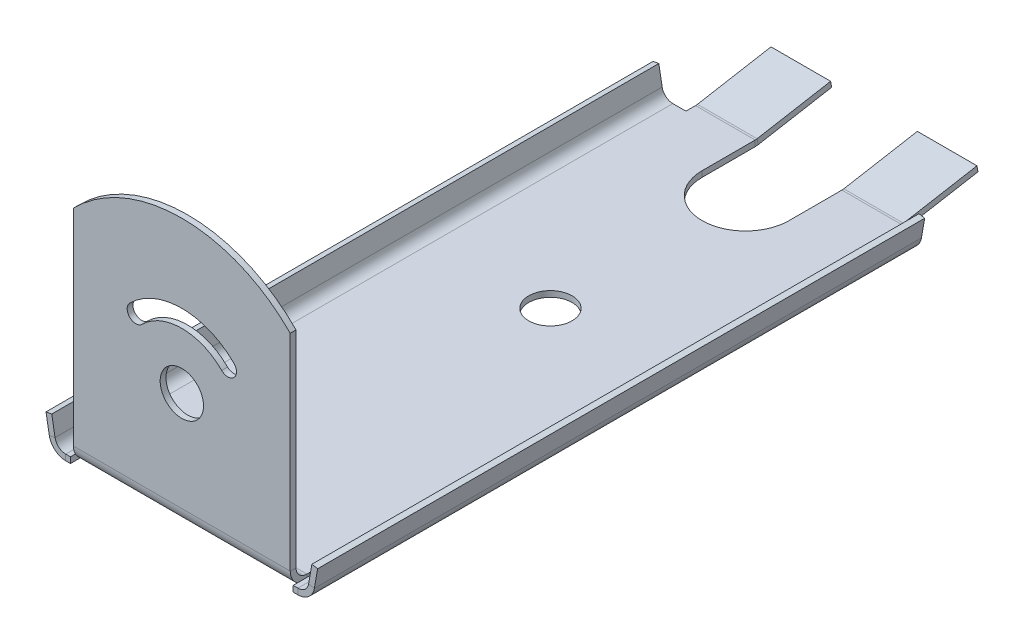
ISO-10303-21;
HEADER;
FILE_DESCRIPTION(('STEP AP214'),'2;1');
FILE_NAME('part.step','',(''),(''),'','','');
FILE_SCHEMA(('AUTOMOTIVE_DESIGN { 1 0 10303 214 1 1 1 1 }'));
ENDSEC;
DATA;
#1=APPLICATION_CONTEXT('core data for automotive mechanical design processes');
#2=APPLICATION_PROTOCOL_DEFINITION('international standard','automotive_design',2000,#1);
#3=PRODUCT_CONTEXT('',#1,'mechanical');
#4=PRODUCT('Part','Part','',(#3));
#5=PRODUCT_RELATED_PRODUCT_CATEGORY('part','',(#4));
#6=PRODUCT_DEFINITION_FORMATION('','',#4);
#7=PRODUCT_DEFINITION_CONTEXT('part definition',#1,'design');
#8=PRODUCT_DEFINITION('design','',#6,#7);
#9=PRODUCT_DEFINITION_SHAPE('','',#8);
#10=(LENGTH_UNIT() NAMED_UNIT(*) SI_UNIT(.MILLI.,.METRE.));
#11=(NAMED_UNIT(*) PLANE_ANGLE_UNIT() SI_UNIT($,.RADIAN.));
#12=(NAMED_UNIT(*) SI_UNIT($,.STERADIAN.) SOLID_ANGLE_UNIT());
#13=UNCERTAINTY_MEASURE_WITH_UNIT(LENGTH_MEASURE(1.E-05),#10,'distance_accuracy_value','');
#14=(GEOMETRIC_REPRESENTATION_CONTEXT(3) GLOBAL_UNCERTAINTY_ASSIGNED_CONTEXT((#13)) GLOBAL_UNIT_ASSIGNED_CONTEXT((#10,
#11,#12)) REPRESENTATION_CONTEXT('',''));
#15=CARTESIAN_POINT('',(0.,0.,0.));
#16=DIRECTION('',(0.,0.,1.));
#17=DIRECTION('',(1.,0.,0.));
#18=AXIS2_PLACEMENT_3D('',#15,#16,#17);
#19=CARTESIAN_POINT('',(-38.1,0.,203.2));
#20=DIRECTION('',(0.,-1.,0.));
#21=DIRECTION('',(0.,0.,-1.));
#22=AXIS2_PLACEMENT_3D('',#19,#20,#21);
#23=PLANE('',#22);
#24=CARTESIAN_POINT('',(0.,0.,95.25));
#25=DIRECTION('',(0.,1.,0.));
#26=DIRECTION('',(0.,0.,1.));
#27=AXIS2_PLACEMENT_3D('',#24,#25,#26);
#28=CIRCLE('',#27,6.35);
#29=CARTESIAN_POINT('',(0.,0.,101.6));
#30=VERTEX_POINT('',#29);
#31=EDGE_CURVE('E391',#30,#30,#28,.T.);
#32=ORIENTED_EDGE('',*,*,#31,.T.);
#33=EDGE_LOOP('',(#32));
#34=FACE_BOUND('',#33,.T.);
#35=DIRECTION('',(0.,0.,1.));
#36=VECTOR('',#35,1.);
#37=CARTESIAN_POINT('',(-30.1625,-3.00236613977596E-13,0.));
#38=LINE('',#37,#36);
#39=CARTESIAN_POINT('',(-30.1625,-3.00236613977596E-13,22.5766585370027));
#40=VERTEX_POINT('',#39);
#41=CARTESIAN_POINT('',(-30.1625,-3.00236613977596E-13,25.4));
#42=VERTEX_POINT('',#41);
#43=EDGE_CURVE('E72',#40,#42,#38,.T.);
#44=ORIENTED_EDGE('',*,*,#43,.F.);
#45=DIRECTION('',(1.,0.,0.));
#46=VECTOR('',#45,1.);
#47=CARTESIAN_POINT('',(-38.1,0.,22.5766585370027));
#48=LINE('',#47,#46);
#49=CARTESIAN_POINT('',(-12.7,0.,22.5766585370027));
#50=VERTEX_POINT('',#49);
#51=EDGE_CURVE('E872',#40,#50,#48,.T.);
#52=ORIENTED_EDGE('',*,*,#51,.T.);
#53=DIRECTION('',(0.,0.,-1.));
#54=VECTOR('',#53,1.);
#55=CARTESIAN_POINT('',(-12.7,-3.00236613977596E-13,0.));
#56=LINE('',#55,#54);
#57=CARTESIAN_POINT('',(-12.7,-3.00236613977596E-13,38.1));
#58=VERTEX_POINT('',#57);
#59=EDGE_CURVE('E545',#58,#50,#56,.T.);
#60=ORIENTED_EDGE('',*,*,#59,.F.);
#61=CARTESIAN_POINT('',(0.,-3.00236613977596E-13,38.1));
#62=DIRECTION('',(0.,-1.,0.));
#63=DIRECTION('',(0.,0.,-1.));
#64=AXIS2_PLACEMENT_3D('',#61,#62,#63);
#65=CIRCLE('',#64,12.7);
#66=CARTESIAN_POINT('',(12.7,-3.00236613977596E-13,38.1));
#67=VERTEX_POINT('',#66);
#68=EDGE_CURVE('E541',#67,#58,#65,.T.);
#69=ORIENTED_EDGE('',*,*,#68,.F.);
#70=DIRECTION('',(0.,0.,1.));
#71=VECTOR('',#70,1.);
#72=CARTESIAN_POINT('',(12.7,-3.00236613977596E-13,0.));
#73=LINE('',#72,#71);
#74=CARTESIAN_POINT('',(12.7,-3.00236613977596E-13,22.5766585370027));
#75=VERTEX_POINT('',#74);
#76=EDGE_CURVE('E546',#75,#67,#73,.T.);
#77=ORIENTED_EDGE('',*,*,#76,.F.);
#78=DIRECTION('',(1.,0.,0.));
#79=VECTOR('',#78,1.);
#80=CARTESIAN_POINT('',(-38.1,0.,22.5766585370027));
#81=LINE('',#80,#79);
#82=CARTESIAN_POINT('',(30.1625,0.,22.5766585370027));
#83=VERTEX_POINT('',#82);
#84=EDGE_CURVE('E888',#75,#83,#81,.T.);
#85=ORIENTED_EDGE('',*,*,#84,.T.);
#86=DIRECTION('',(0.,0.,-1.));
#87=VECTOR('',#86,1.);
#88=CARTESIAN_POINT('',(30.1625,-3.00236613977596E-13,0.));
#89=LINE('',#88,#87);
#90=CARTESIAN_POINT('',(30.1625,-3.00236613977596E-13,25.4));
#91=VERTEX_POINT('',#90);
#92=EDGE_CURVE('E535',#91,#83,#89,.T.);
#93=ORIENTED_EDGE('',*,*,#92,.F.);
#94=DIRECTION('',(-1.,0.,0.));
#95=VECTOR('',#94,1.);
#96=CARTESIAN_POINT('',(39.7795144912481,-3.00236613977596E-13,25.4));
#97=LINE('',#96,#95);
#98=CARTESIAN_POINT('',(34.0014849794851,-3.00236613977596E-13,25.4));
#99=VERTEX_POINT('',#98);
#100=EDGE_CURVE('E531',#99,#91,#97,.T.);
#101=ORIENTED_EDGE('',*,*,#100,.F.);
#102=DIRECTION('',(0.,0.,-1.));
#103=VECTOR('',#102,1.);
#104=CARTESIAN_POINT('',(34.0014849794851,0.,203.2));
#105=LINE('',#104,#103);
#106=CARTESIAN_POINT('',(34.0014849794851,0.,203.2));
#107=VERTEX_POINT('',#106);
#108=EDGE_CURVE('E815',#107,#99,#105,.T.);
#109=ORIENTED_EDGE('',*,*,#108,.F.);
#110=DIRECTION('',(-1.,0.,0.));
#111=VECTOR('',#110,1.);
#112=CARTESIAN_POINT('',(-38.1,0.,203.2));
#113=LINE('',#112,#111);
#114=CARTESIAN_POINT('',(32.60471,0.,203.2));
#115=VERTEX_POINT('',#114);
#116=EDGE_CURVE('E754',#107,#115,#113,.T.);
#117=ORIENTED_EDGE('',*,*,#116,.T.);
#118=DIRECTION('',(0.,0.,-1.));
#119=VECTOR('',#118,1.);
#120=CARTESIAN_POINT('',(32.60471,0.,203.2));
#121=LINE('',#120,#119);
#122=CARTESIAN_POINT('',(32.60471,0.,197.46087));
#123=VERTEX_POINT('',#122);
#124=EDGE_CURVE('E735',#115,#123,#121,.T.);
#125=ORIENTED_EDGE('',*,*,#124,.T.);
#126=CARTESIAN_POINT('',(32.177355,0.,197.46087));
#127=DIRECTION('',(0.,-1.,0.));
#128=DIRECTION('',(0.,0.,-1.));
#129=AXIS2_PLACEMENT_3D('',#126,#127,#128);
#130=CIRCLE('',#129,0.427355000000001);
#131=CARTESIAN_POINT('',(31.75,0.,197.46087));
#132=VERTEX_POINT('',#131);
#133=EDGE_CURVE('E732',#123,#132,#130,.F.);
#134=ORIENTED_EDGE('',*,*,#133,.T.);
#135=DIRECTION('',(0.,0.,1.));
#136=VECTOR('',#135,1.);
#137=CARTESIAN_POINT('',(31.75,0.,203.2));
#138=LINE('',#137,#136);
#139=CARTESIAN_POINT('',(31.75,0.,198.31558));
#140=VERTEX_POINT('',#139);
#141=EDGE_CURVE('E728',#132,#140,#138,.T.);
#142=ORIENTED_EDGE('',*,*,#141,.T.);
#143=DIRECTION('',(1.,0.,0.));
#144=VECTOR('',#143,1.);
#145=CARTESIAN_POINT('',(31.75,0.,198.31558));
#146=LINE('',#145,#144);
#147=CARTESIAN_POINT('',(-31.75,0.,198.31558));
#148=VERTEX_POINT('',#147);
#149=EDGE_CURVE('E642',#140,#148,#146,.F.);
#150=ORIENTED_EDGE('',*,*,#149,.T.);
#151=DIRECTION('',(0.,0.,-1.));
#152=VECTOR('',#151,1.);
#153=CARTESIAN_POINT('',(-31.75,0.,203.2));
#154=LINE('',#153,#152);
#155=CARTESIAN_POINT('',(-31.75,0.,197.46087));
#156=VERTEX_POINT('',#155);
#157=EDGE_CURVE('E725',#148,#156,#154,.T.);
#158=ORIENTED_EDGE('',*,*,#157,.T.);
#159=CARTESIAN_POINT('',(-32.177355,0.,197.46087));
#160=DIRECTION('',(0.,-1.,0.));
#161=DIRECTION('',(0.,0.,-1.));
#162=AXIS2_PLACEMENT_3D('',#159,#160,#161);
#163=CIRCLE('',#162,0.427355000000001);
#164=CARTESIAN_POINT('',(-32.60471,0.,197.46087));
#165=VERTEX_POINT('',#164);
#166=EDGE_CURVE('E722',#156,#165,#163,.F.);
#167=ORIENTED_EDGE('',*,*,#166,.T.);
#168=DIRECTION('',(0.,0.,1.));
#169=VECTOR('',#168,1.);
#170=CARTESIAN_POINT('',(-32.60471,0.,203.2));
#171=LINE('',#170,#169);
#172=CARTESIAN_POINT('',(-32.60471,0.,203.2));
#173=VERTEX_POINT('',#172);
#174=EDGE_CURVE('E677',#165,#173,#171,.T.);
#175=ORIENTED_EDGE('',*,*,#174,.T.);
#176=CARTESIAN_POINT('',(-34.0014849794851,0.,203.2));
#177=VERTEX_POINT('',#176);
#178=EDGE_CURVE('E753',#173,#177,#113,.T.);
#179=ORIENTED_EDGE('',*,*,#178,.T.);
#180=DIRECTION('',(0.,0.,-1.));
#181=VECTOR('',#180,1.);
#182=CARTESIAN_POINT('',(-34.0014849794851,0.,203.2));
#183=LINE('',#182,#181);
#184=CARTESIAN_POINT('',(-34.0014849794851,-3.00236613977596E-13,25.4));
#185=VERTEX_POINT('',#184);
#186=EDGE_CURVE('E819',#177,#185,#183,.T.);
#187=ORIENTED_EDGE('',*,*,#186,.T.);
#188=DIRECTION('',(-1.,0.,0.));
#189=VECTOR('',#188,1.);
#190=CARTESIAN_POINT('',(-39.7795144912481,-3.00236613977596E-13,25.4));
#191=LINE('',#190,#189);
#192=EDGE_CURVE('E553',#42,#185,#191,.T.);
#193=ORIENTED_EDGE('',*,*,#192,.F.);
#194=EDGE_LOOP('',(#44,#52,#60,#69,#77,#85,#93,#101,#109,#117,#125,#134,#142,#150,#158,#167,
#175,#179,#187,#193));
#195=FACE_BOUND('',#194,.T.);
#196=ADVANCED_FACE('F68',(#34,#195),#23,.T.);
#197=CARTESIAN_POINT('',(39.7795144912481,78.5509002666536,25.4));
#198=DIRECTION('',(0.,0.,1.));
#199=DIRECTION('',(1.,0.,0.));
#200=AXIS2_PLACEMENT_3D('',#197,#198,#199);
#201=PLANE('',#200);
#202=DIRECTION('',(-0.173648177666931,-0.984807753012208,0.));
#203=VECTOR('',#202,1.);
#204=CARTESIAN_POINT('',(38.1,0.,25.4));
#205=LINE('',#204,#203);
#206=CARTESIAN_POINT('',(39.7795144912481,9.525,25.4));
#207=VERTEX_POINT('',#206);
#208=CARTESIAN_POINT('',(38.811699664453,4.03624936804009,25.4));
#209=VERTEX_POINT('',#208);
#210=EDGE_CURVE('E585',#207,#209,#205,.T.);
#211=ORIENTED_EDGE('',*,*,#210,.T.);
#212=DIRECTION('',(-0.984807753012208,0.17364817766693,0.));
#213=VECTOR('',#212,1.);
#214=CARTESIAN_POINT('',(38.811699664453,4.03624936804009,25.4));
#215=LINE('',#214,#213);
#216=CARTESIAN_POINT('',(37.1282495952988,4.33308703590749,25.4));
#217=VERTEX_POINT('',#216);
#218=EDGE_CURVE('E869',#209,#217,#215,.T.);
#219=ORIENTED_EDGE('',*,*,#218,.T.);
#220=DIRECTION('',(-0.173648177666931,-0.984807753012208,0.));
#221=VECTOR('',#220,1.);
#222=CARTESIAN_POINT('',(36.4165499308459,0.296837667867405,25.4));
#223=LINE('',#222,#221);
#224=CARTESIAN_POINT('',(38.096064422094,9.8218376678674,25.4));
#225=VERTEX_POINT('',#224);
#226=EDGE_CURVE('E578',#225,#217,#223,.T.);
#227=ORIENTED_EDGE('',*,*,#226,.F.);
#228=DIRECTION('',(0.984807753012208,-0.173648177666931,0.));
#229=VECTOR('',#228,1.);
#230=CARTESIAN_POINT('',(38.096064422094,9.8218376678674,25.4));
#231=LINE('',#230,#229);
#232=EDGE_CURVE('E582',#225,#207,#231,.T.);
#233=ORIENTED_EDGE('',*,*,#232,.T.);
#234=EDGE_LOOP('',(#211,#219,#227,#233));
#235=FACE_BOUND('',#234,.T.);
#236=ADVANCED_FACE('F1082',(#235),#201,.F.);
#237=DIRECTION('',(-1.,0.,0.));
#238=VECTOR('',#237,1.);
#239=CARTESIAN_POINT('',(-38.1,1.70942,25.4));
#240=LINE('',#239,#238);
#241=CARTESIAN_POINT('',(34.001484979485,1.70942,25.4));
#242=VERTEX_POINT('',#241);
#243=CARTESIAN_POINT('',(30.1625,1.70942,25.4));
#244=VERTEX_POINT('',#243);
#245=EDGE_CURVE('E593',#242,#244,#240,.T.);
#246=ORIENTED_EDGE('',*,*,#245,.F.);
#247=DIRECTION('',(0.,-1.,0.));
#248=VECTOR('',#247,1.);
#249=CARTESIAN_POINT('',(34.001484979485,1.70942,25.4));
#250=LINE('',#249,#248);
#251=EDGE_CURVE('E866',#242,#99,#250,.T.);
#252=ORIENTED_EDGE('',*,*,#251,.T.);
#253=ORIENTED_EDGE('',*,*,#100,.T.);
#254=DIRECTION('',(0.,-1.,0.));
#255=VECTOR('',#254,1.);
#256=CARTESIAN_POINT('',(30.1625,78.5509002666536,25.4));
#257=LINE('',#256,#255);
#258=EDGE_CURVE('E537',#244,#91,#257,.T.);
#259=ORIENTED_EDGE('',*,*,#258,.F.);
#260=EDGE_LOOP('',(#246,#252,#253,#259));
#261=FACE_BOUND('',#260,.T.);
#262=ADVANCED_FACE('F1088',(#261),#201,.F.);
#263=CARTESIAN_POINT('',(-39.7795144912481,78.5509002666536,25.4));
#264=DIRECTION('',(0.,0.,1.));
#265=DIRECTION('',(1.,0.,0.));
#266=AXIS2_PLACEMENT_3D('',#263,#264,#265);
#267=PLANE('',#266);
#268=DIRECTION('',(-0.173648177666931,0.984807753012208,0.));
#269=VECTOR('',#268,1.);
#270=CARTESIAN_POINT('',(-36.4165499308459,0.296837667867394,25.4));
#271=LINE('',#270,#269);
#272=CARTESIAN_POINT('',(-37.1282495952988,4.3330870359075,25.4));
#273=VERTEX_POINT('',#272);
#274=CARTESIAN_POINT('',(-38.096064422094,9.8218376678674,25.4));
#275=VERTEX_POINT('',#274);
#276=EDGE_CURVE('E540',#273,#275,#271,.T.);
#277=ORIENTED_EDGE('',*,*,#276,.F.);
#278=DIRECTION('',(-0.984807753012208,-0.173648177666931,0.));
#279=VECTOR('',#278,1.);
#280=CARTESIAN_POINT('',(-37.1282495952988,4.3330870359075,25.4));
#281=LINE('',#280,#279);
#282=CARTESIAN_POINT('',(-38.811699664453,4.03624936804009,25.4));
#283=VERTEX_POINT('',#282);
#284=EDGE_CURVE('E863',#273,#283,#281,.T.);
#285=ORIENTED_EDGE('',*,*,#284,.T.);
#286=DIRECTION('',(-0.173648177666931,0.984807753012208,0.));
#287=VECTOR('',#286,1.);
#288=CARTESIAN_POINT('',(-38.1,0.,25.4));
#289=LINE('',#288,#287);
#290=CARTESIAN_POINT('',(-39.7795144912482,9.52500000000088,25.4));
#291=VERTEX_POINT('',#290);
#292=EDGE_CURVE('E571',#283,#291,#289,.T.);
#293=ORIENTED_EDGE('',*,*,#292,.T.);
#294=DIRECTION('',(0.984807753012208,0.173648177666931,0.));
#295=VECTOR('',#294,1.);
#296=CARTESIAN_POINT('',(-39.7795144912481,9.52500000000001,25.4));
#297=LINE('',#296,#295);
#298=EDGE_CURVE('E568',#291,#275,#297,.T.);
#299=ORIENTED_EDGE('',*,*,#298,.T.);
#300=EDGE_LOOP('',(#277,#285,#293,#299));
#301=FACE_BOUND('',#300,.T.);
#302=ADVANCED_FACE('F1008',(#301),#267,.F.);
#303=ORIENTED_EDGE('',*,*,#192,.T.);
#304=DIRECTION('',(0.,1.,0.));
#305=VECTOR('',#304,1.);
#306=CARTESIAN_POINT('',(-34.0014849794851,-3.00236613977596E-13,25.4));
#307=LINE('',#306,#305);
#308=CARTESIAN_POINT('',(-34.0014849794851,1.70942,25.4));
#309=VERTEX_POINT('',#308);
#310=EDGE_CURVE('E860',#185,#309,#307,.T.);
#311=ORIENTED_EDGE('',*,*,#310,.T.);
#312=DIRECTION('',(-1.,0.,0.));
#313=VECTOR('',#312,1.);
#314=CARTESIAN_POINT('',(-38.0999999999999,1.70942,25.4));
#315=LINE('',#314,#313);
#316=CARTESIAN_POINT('',(-30.1625,1.70942,25.4));
#317=VERTEX_POINT('',#316);
#318=EDGE_CURVE('E564',#317,#309,#315,.T.);
#319=ORIENTED_EDGE('',*,*,#318,.F.);
#320=DIRECTION('',(0.,-1.,0.));
#321=VECTOR('',#320,1.);
#322=CARTESIAN_POINT('',(-30.1625,78.5509002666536,25.4));
#323=LINE('',#322,#321);
#324=EDGE_CURVE('E557',#317,#42,#323,.T.);
#325=ORIENTED_EDGE('',*,*,#324,.T.);
#326=EDGE_LOOP('',(#303,#311,#319,#325));
#327=FACE_BOUND('',#326,.T.);
#328=ADVANCED_FACE('F923',(#327),#267,.F.);
#329=CARTESIAN_POINT('',(37.1282495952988,4.33308703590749,203.2));
#330=DIRECTION('',(0.,0.,1.));
#331=DIRECTION('',(1.,0.,0.));
#332=AXIS2_PLACEMENT_3D('',#329,#330,#331);
#333=PLANE('',#332);
#334=DIRECTION('',(1.,0.,0.));
#335=VECTOR('',#334,1.);
#336=CARTESIAN_POINT('',(-38.1,1.70942,203.2));
#337=LINE('',#336,#335);
#338=CARTESIAN_POINT('',(34.001484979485,1.70942,203.2));
#339=VERTEX_POINT('',#338);
#340=CARTESIAN_POINT('',(32.60471,1.70942,203.2));
#341=VERTEX_POINT('',#340);
#342=EDGE_CURVE('E779',#339,#341,#337,.F.);
#343=ORIENTED_EDGE('',*,*,#342,.T.);
#344=DIRECTION('',(0.,-1.,0.));
#345=VECTOR('',#344,1.);
#346=CARTESIAN_POINT('',(32.60471,1.70941999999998,203.2));
#347=LINE('',#346,#345);
#348=EDGE_CURVE('E678',#341,#115,#347,.T.);
#349=ORIENTED_EDGE('',*,*,#348,.T.);
#350=ORIENTED_EDGE('',*,*,#116,.F.);
#351=DIRECTION('',(0.,1.,0.));
#352=VECTOR('',#351,1.);
#353=CARTESIAN_POINT('',(34.0014849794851,0.,203.2));
#354=LINE('',#353,#352);
#355=EDGE_CURVE('E845',#107,#339,#354,.T.);
#356=ORIENTED_EDGE('',*,*,#355,.T.);
#357=EDGE_LOOP('',(#343,#349,#350,#356));
#358=FACE_BOUND('',#357,.T.);
#359=ADVANCED_FACE('F1108',(#358),#333,.T.);
#360=ORIENTED_EDGE('',*,*,#178,.F.);
#361=DIRECTION('',(0.,-1.,0.));
#362=VECTOR('',#361,1.);
#363=CARTESIAN_POINT('',(-32.60471,1.70941999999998,203.2));
#364=LINE('',#363,#362);
#365=CARTESIAN_POINT('',(-32.60471,1.70941999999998,203.2));
#366=VERTEX_POINT('',#365);
#367=EDGE_CURVE('E702',#366,#173,#364,.T.);
#368=ORIENTED_EDGE('',*,*,#367,.F.);
#369=CARTESIAN_POINT('',(-34.0014849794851,1.70942,203.2));
#370=VERTEX_POINT('',#369);
#371=EDGE_CURVE('E778',#366,#370,#337,.F.);
#372=ORIENTED_EDGE('',*,*,#371,.T.);
#373=DIRECTION('',(0.,-1.,0.));
#374=VECTOR('',#373,1.);
#375=CARTESIAN_POINT('',(-34.0014849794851,1.70942,203.2));
#376=LINE('',#375,#374);
#377=EDGE_CURVE('E835',#370,#177,#376,.T.);
#378=ORIENTED_EDGE('',*,*,#377,.T.);
#379=EDGE_LOOP('',(#360,#368,#372,#378));
#380=FACE_BOUND('',#379,.T.);
#381=ADVANCED_FACE('F1026',(#380),#333,.T.);
#382=CARTESIAN_POINT('',(-38.1,1.70942,203.2));
#383=DIRECTION('',(0.,-1.,0.));
#384=DIRECTION('',(0.,0.,-1.));
#385=AXIS2_PLACEMENT_3D('',#382,#383,#384);
#386=PLANE('',#385);
#387=CARTESIAN_POINT('',(0.,1.70942,95.25));
#388=DIRECTION('',(0.,1.,0.));
#389=DIRECTION('',(0.,0.,1.));
#390=AXIS2_PLACEMENT_3D('',#387,#388,#389);
#391=CIRCLE('',#390,6.35);
#392=CARTESIAN_POINT('',(0.,1.70942,101.6));
#393=VERTEX_POINT('',#392);
#394=EDGE_CURVE('E381',#393,#393,#391,.T.);
#395=ORIENTED_EDGE('',*,*,#394,.F.);
#396=EDGE_LOOP('',(#395));
#397=FACE_BOUND('',#396,.T.);
#398=DIRECTION('',(1.,0.,0.));
#399=VECTOR('',#398,1.);
#400=CARTESIAN_POINT('',(-38.1,1.70942,22.5766585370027));
#401=LINE('',#400,#399);
#402=CARTESIAN_POINT('',(-30.1625,1.70942,22.5766585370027));
#403=VERTEX_POINT('',#402);
#404=CARTESIAN_POINT('',(-12.7,1.70942,22.5766585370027));
#405=VERTEX_POINT('',#404);
#406=EDGE_CURVE('E880',#403,#405,#401,.T.);
#407=ORIENTED_EDGE('',*,*,#406,.F.);
#408=DIRECTION('',(0.,0.,1.));
#409=VECTOR('',#408,1.);
#410=CARTESIAN_POINT('',(-30.1625,1.70942,203.2));
#411=LINE('',#410,#409);
#412=EDGE_CURVE('E597',#403,#317,#411,.T.);
#413=ORIENTED_EDGE('',*,*,#412,.T.);
#414=ORIENTED_EDGE('',*,*,#318,.T.);
#415=DIRECTION('',(0.,0.,-1.));
#416=VECTOR('',#415,1.);
#417=CARTESIAN_POINT('',(-34.0014849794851,1.70942,203.2));
#418=LINE('',#417,#416);
#419=EDGE_CURVE('E791',#370,#309,#418,.T.);
#420=ORIENTED_EDGE('',*,*,#419,.F.);
#421=ORIENTED_EDGE('',*,*,#371,.F.);
#422=DIRECTION('',(0.,0.,1.));
#423=VECTOR('',#422,1.);
#424=CARTESIAN_POINT('',(-32.60471,1.70941999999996,197.46087));
#425=LINE('',#424,#423);
#426=CARTESIAN_POINT('',(-32.60471,1.70942,197.46087));
#427=VERTEX_POINT('',#426);
#428=EDGE_CURVE('E698',#427,#366,#425,.T.);
#429=ORIENTED_EDGE('',*,*,#428,.F.);
#430=CARTESIAN_POINT('',(-32.177355,1.70941999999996,197.46087));
#431=DIRECTION('',(0.,1.,0.));
#432=DIRECTION('',(0.,0.,1.));
#433=AXIS2_PLACEMENT_3D('',#430,#431,#432);
#434=CIRCLE('',#433,0.427355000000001);
#435=CARTESIAN_POINT('',(-31.75,1.70942,197.46087));
#436=VERTEX_POINT('',#435);
#437=EDGE_CURVE('E693',#436,#427,#434,.T.);
#438=ORIENTED_EDGE('',*,*,#437,.F.);
#439=DIRECTION('',(0.,0.,-1.));
#440=VECTOR('',#439,1.);
#441=CARTESIAN_POINT('',(-31.75,1.70941999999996,198.31558));
#442=LINE('',#441,#440);
#443=CARTESIAN_POINT('',(-31.75,1.70941999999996,198.31558));
#444=VERTEX_POINT('',#443);
#445=EDGE_CURVE('E689',#444,#436,#442,.T.);
#446=ORIENTED_EDGE('',*,*,#445,.F.);
#447=DIRECTION('',(1.,0.,0.));
#448=VECTOR('',#447,1.);
#449=CARTESIAN_POINT('',(31.75,1.70941999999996,198.31558));
#450=LINE('',#449,#448);
#451=CARTESIAN_POINT('',(31.75,1.70941999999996,198.31558));
#452=VERTEX_POINT('',#451);
#453=EDGE_CURVE('E659',#452,#444,#450,.F.);
#454=ORIENTED_EDGE('',*,*,#453,.F.);
#455=DIRECTION('',(0.,0.,1.));
#456=VECTOR('',#455,1.);
#457=CARTESIAN_POINT('',(31.75,1.70941999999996,197.46087));
#458=LINE('',#457,#456);
#459=CARTESIAN_POINT('',(31.75,1.70942,197.46087));
#460=VERTEX_POINT('',#459);
#461=EDGE_CURVE('E684',#460,#452,#458,.T.);
#462=ORIENTED_EDGE('',*,*,#461,.F.);
#463=CARTESIAN_POINT('',(32.177355,1.70941999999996,197.46087));
#464=DIRECTION('',(0.,1.,0.));
#465=DIRECTION('',(0.,0.,1.));
#466=AXIS2_PLACEMENT_3D('',#463,#464,#465);
#467=CIRCLE('',#466,0.427355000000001);
#468=CARTESIAN_POINT('',(32.60471,1.70942,197.46087));
#469=VERTEX_POINT('',#468);
#470=EDGE_CURVE('E679',#469,#460,#467,.T.);
#471=ORIENTED_EDGE('',*,*,#470,.F.);
#472=DIRECTION('',(0.,0.,-1.));
#473=VECTOR('',#472,1.);
#474=CARTESIAN_POINT('',(32.60471,1.70941999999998,203.2));
#475=LINE('',#474,#473);
#476=EDGE_CURVE('E673',#341,#469,#475,.T.);
#477=ORIENTED_EDGE('',*,*,#476,.F.);
#478=ORIENTED_EDGE('',*,*,#342,.F.);
#479=DIRECTION('',(0.,0.,-1.));
#480=VECTOR('',#479,1.);
#481=CARTESIAN_POINT('',(34.001484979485,1.70942,203.2));
#482=LINE('',#481,#480);
#483=EDGE_CURVE('E795',#339,#242,#482,.T.);
#484=ORIENTED_EDGE('',*,*,#483,.T.);
#485=ORIENTED_EDGE('',*,*,#245,.T.);
#486=DIRECTION('',(0.,0.,-1.));
#487=VECTOR('',#486,1.);
#488=CARTESIAN_POINT('',(30.1625,1.70942,203.2));
#489=LINE('',#488,#487);
#490=CARTESIAN_POINT('',(30.1625,1.70942,22.5766585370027));
#491=VERTEX_POINT('',#490);
#492=EDGE_CURVE('E641',#244,#491,#489,.T.);
#493=ORIENTED_EDGE('',*,*,#492,.T.);
#494=DIRECTION('',(1.,0.,0.));
#495=VECTOR('',#494,1.);
#496=CARTESIAN_POINT('',(-38.1,1.70942,22.5766585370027));
#497=LINE('',#496,#495);
#498=CARTESIAN_POINT('',(12.7,1.70942,22.5766585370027));
#499=VERTEX_POINT('',#498);
#500=EDGE_CURVE('E78',#499,#491,#497,.T.);
#501=ORIENTED_EDGE('',*,*,#500,.F.);
#502=DIRECTION('',(0.,0.,1.));
#503=VECTOR('',#502,1.);
#504=CARTESIAN_POINT('',(12.7,1.70942,203.2));
#505=LINE('',#504,#503);
#506=CARTESIAN_POINT('',(12.7,1.70942,38.1));
#507=VERTEX_POINT('',#506);
#508=EDGE_CURVE('E904',#499,#507,#505,.T.);
#509=ORIENTED_EDGE('',*,*,#508,.T.);
#510=CARTESIAN_POINT('',(0.,1.70942,38.1));
#511=DIRECTION('',(0.,-1.,0.));
#512=DIRECTION('',(0.,0.,-1.));
#513=AXIS2_PLACEMENT_3D('',#510,#511,#512);
#514=CIRCLE('',#513,12.7);
#515=CARTESIAN_POINT('',(-12.7,1.70942,38.1));
#516=VERTEX_POINT('',#515);
#517=EDGE_CURVE('E856',#507,#516,#514,.T.);
#518=ORIENTED_EDGE('',*,*,#517,.T.);
#519=DIRECTION('',(0.,0.,-1.));
#520=VECTOR('',#519,1.);
#521=CARTESIAN_POINT('',(-12.7,1.70942,203.2));
#522=LINE('',#521,#520);
#523=EDGE_CURVE('E903',#516,#405,#522,.T.);
#524=ORIENTED_EDGE('',*,*,#523,.T.);
#525=EDGE_LOOP('',(#407,#413,#414,#420,#421,#429,#438,#446,#454,#462,#471,#477,#478,#484,#485,
#493,#501,#509,#518,#524));
#526=FACE_BOUND('',#525,.T.);
#527=ADVANCED_FACE('F917',(#397,#526),#386,.F.);
#528=CARTESIAN_POINT('',(34.0014849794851,0.,203.2));
#529=DIRECTION('',(0.,0.,1.));
#530=DIRECTION('',(1.,0.,0.));
#531=AXIS2_PLACEMENT_3D('',#528,#529,#530);
#532=PLANE('',#531);
#533=ORIENTED_EDGE('',*,*,#355,.F.);
#534=CARTESIAN_POINT('',(34.0014849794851,4.88442,203.2));
#535=DIRECTION('',(0.,0.,1.));
#536=DIRECTION('',(1.,0.,0.));
#537=AXIS2_PLACEMENT_3D('',#534,#535,#536);
#538=CIRCLE('',#537,4.88442);
#539=CARTESIAN_POINT('',(38.811699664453,4.03624936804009,203.2));
#540=VERTEX_POINT('',#539);
#541=EDGE_CURVE('E758',#540,#107,#538,.F.);
#542=ORIENTED_EDGE('',*,*,#541,.F.);
#543=DIRECTION('',(0.984807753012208,-0.17364817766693,0.));
#544=VECTOR('',#543,1.);
#545=CARTESIAN_POINT('',(37.1282495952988,4.33308703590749,203.2));
#546=LINE('',#545,#544);
#547=CARTESIAN_POINT('',(37.1282495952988,4.33308703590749,203.2));
#548=VERTEX_POINT('',#547);
#549=EDGE_CURVE('E842',#548,#540,#546,.T.);
#550=ORIENTED_EDGE('',*,*,#549,.F.);
#551=CARTESIAN_POINT('',(34.0014849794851,4.88442,203.2));
#552=DIRECTION('',(0.,0.,1.));
#553=DIRECTION('',(1.,0.,0.));
#554=AXIS2_PLACEMENT_3D('',#551,#552,#553);
#555=CIRCLE('',#554,3.175);
#556=EDGE_CURVE('E774',#548,#339,#555,.F.);
#557=ORIENTED_EDGE('',*,*,#556,.T.);
#558=EDGE_LOOP('',(#533,#542,#550,#557));
#559=FACE_BOUND('',#558,.T.);
#560=ADVANCED_FACE('F1099',(#559),#532,.T.);
#561=CARTESIAN_POINT('',(-38.811699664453,4.03624936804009,203.2));
#562=DIRECTION('',(0.,0.,1.));
#563=DIRECTION('',(1.,0.,0.));
#564=AXIS2_PLACEMENT_3D('',#561,#562,#563);
#565=PLANE('',#564);
#566=DIRECTION('',(0.984807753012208,0.173648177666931,0.));
#567=VECTOR('',#566,1.);
#568=CARTESIAN_POINT('',(-38.811699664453,4.03624936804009,203.2));
#569=LINE('',#568,#567);
#570=CARTESIAN_POINT('',(-38.811699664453,4.03624936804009,203.2));
#571=VERTEX_POINT('',#570);
#572=CARTESIAN_POINT('',(-37.1282495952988,4.3330870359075,203.2));
#573=VERTEX_POINT('',#572);
#574=EDGE_CURVE('E839',#571,#573,#569,.T.);
#575=ORIENTED_EDGE('',*,*,#574,.F.);
#576=CARTESIAN_POINT('',(-34.0014849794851,4.88442,203.2));
#577=DIRECTION('',(0.,0.,1.));
#578=DIRECTION('',(1.,0.,0.));
#579=AXIS2_PLACEMENT_3D('',#576,#577,#578);
#580=CIRCLE('',#579,4.88442);
#581=EDGE_CURVE('E749',#177,#571,#580,.F.);
#582=ORIENTED_EDGE('',*,*,#581,.F.);
#583=ORIENTED_EDGE('',*,*,#377,.F.);
#584=CARTESIAN_POINT('',(-34.0014849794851,4.88442,203.2));
#585=DIRECTION('',(0.,0.,1.));
#586=DIRECTION('',(1.,0.,0.));
#587=AXIS2_PLACEMENT_3D('',#584,#585,#586);
#588=CIRCLE('',#587,3.175);
#589=EDGE_CURVE('E783',#370,#573,#588,.F.);
#590=ORIENTED_EDGE('',*,*,#589,.T.);
#591=EDGE_LOOP('',(#575,#582,#583,#590));
#592=FACE_BOUND('',#591,.T.);
#593=ADVANCED_FACE('F1105',(#592),#565,.T.);
#594=CARTESIAN_POINT('',(-34.0014849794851,1.70942,203.2));
#595=DIRECTION('',(0.,0.,1.));
#596=DIRECTION('',(1.,0.,0.));
#597=AXIS2_PLACEMENT_3D('',#594,#595,#596);
#598=PLANE('',#597);
#599=DIRECTION('',(-0.173648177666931,0.984807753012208,0.));
#600=VECTOR('',#599,1.);
#601=CARTESIAN_POINT('',(-38.1,0.,203.2));
#602=LINE('',#601,#600);
#603=CARTESIAN_POINT('',(-39.7795144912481,9.525,203.2));
#604=VERTEX_POINT('',#603);
#605=EDGE_CURVE('E745',#571,#604,#602,.T.);
#606=ORIENTED_EDGE('',*,*,#605,.F.);
#607=ORIENTED_EDGE('',*,*,#574,.T.);
#608=DIRECTION('',(-0.173648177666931,0.984807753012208,0.));
#609=VECTOR('',#608,1.);
#610=CARTESIAN_POINT('',(-36.4165499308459,0.296837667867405,203.2));
#611=LINE('',#610,#609);
#612=CARTESIAN_POINT('',(-38.096064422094,9.8218376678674,203.2));
#613=VERTEX_POINT('',#612);
#614=EDGE_CURVE('E738',#573,#613,#611,.T.);
#615=ORIENTED_EDGE('',*,*,#614,.T.);
#616=DIRECTION('',(0.984807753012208,0.173648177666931,0.));
#617=VECTOR('',#616,1.);
#618=CARTESIAN_POINT('',(-39.7795144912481,9.525,203.2));
#619=LINE('',#618,#617);
#620=EDGE_CURVE('E741',#604,#613,#619,.T.);
#621=ORIENTED_EDGE('',*,*,#620,.F.);
#622=EDGE_LOOP('',(#606,#607,#615,#621));
#623=FACE_BOUND('',#622,.T.);
#624=ADVANCED_FACE('F1335',(#623),#598,.T.);
#625=CARTESIAN_POINT('',(-36.4165499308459,0.296837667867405,203.2));
#626=DIRECTION('',(-0.984807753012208,-0.173648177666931,0.));
#627=DIRECTION('',(0.173648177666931,-0.984807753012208,0.));
#628=AXIS2_PLACEMENT_3D('',#625,#626,#627);
#629=PLANE('',#628);
#630=DIRECTION('',(0.,0.,-1.));
#631=VECTOR('',#630,1.);
#632=CARTESIAN_POINT('',(-37.1282495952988,4.3330870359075,203.2));
#633=LINE('',#632,#631);
#634=EDGE_CURVE('E787',#573,#273,#633,.T.);
#635=ORIENTED_EDGE('',*,*,#634,.T.);
#636=ORIENTED_EDGE('',*,*,#276,.T.);
#637=DIRECTION('',(0.,0.,-1.));
#638=VECTOR('',#637,1.);
#639=CARTESIAN_POINT('',(-38.096064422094,9.8218376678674,203.2));
#640=LINE('',#639,#638);
#641=EDGE_CURVE('E831',#613,#275,#640,.T.);
#642=ORIENTED_EDGE('',*,*,#641,.F.);
#643=ORIENTED_EDGE('',*,*,#614,.F.);
#644=EDGE_LOOP('',(#635,#636,#642,#643));
#645=FACE_BOUND('',#644,.T.);
#646=ADVANCED_FACE('F1015',(#645),#629,.F.);
#647=CARTESIAN_POINT('',(-39.7795144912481,9.525,203.2));
#648=DIRECTION('',(-0.173648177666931,0.984807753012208,0.));
#649=DIRECTION('',(-0.984807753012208,-0.173648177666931,0.));
#650=AXIS2_PLACEMENT_3D('',#647,#648,#649);
#651=PLANE('',#650);
#652=ORIENTED_EDGE('',*,*,#298,.F.);
#653=DIRECTION('',(0.,0.,-1.));
#654=VECTOR('',#653,1.);
#655=CARTESIAN_POINT('',(-39.7795144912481,9.525,203.2));
#656=LINE('',#655,#654);
#657=EDGE_CURVE('E827',#604,#291,#656,.T.);
#658=ORIENTED_EDGE('',*,*,#657,.F.);
#659=ORIENTED_EDGE('',*,*,#620,.T.);
#660=ORIENTED_EDGE('',*,*,#641,.T.);
#661=EDGE_LOOP('',(#652,#658,#659,#660));
#662=FACE_BOUND('',#661,.T.);
#663=ADVANCED_FACE('F1010',(#662),#651,.T.);
#664=CARTESIAN_POINT('',(-38.1,0.,203.2));
#665=DIRECTION('',(-0.984807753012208,-0.173648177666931,0.));
#666=DIRECTION('',(0.173648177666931,-0.984807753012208,0.));
#667=AXIS2_PLACEMENT_3D('',#664,#665,#666);
#668=PLANE('',#667);
#669=ORIENTED_EDGE('',*,*,#292,.F.);
#670=DIRECTION('',(0.,0.,-1.));
#671=VECTOR('',#670,1.);
#672=CARTESIAN_POINT('',(-38.811699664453,4.03624936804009,203.2));
#673=LINE('',#672,#671);
#674=EDGE_CURVE('E823',#571,#283,#673,.T.);
#675=ORIENTED_EDGE('',*,*,#674,.F.);
#676=ORIENTED_EDGE('',*,*,#605,.T.);
#677=ORIENTED_EDGE('',*,*,#657,.T.);
#678=EDGE_LOOP('',(#669,#675,#676,#677));
#679=FACE_BOUND('',#678,.T.);
#680=ADVANCED_FACE('F1004',(#679),#668,.T.);
#681=CARTESIAN_POINT('',(-34.0014849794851,4.88442,203.2));
#682=DIRECTION('',(0.,0.,-1.));
#683=DIRECTION('',(-1.,0.,0.));
#684=AXIS2_PLACEMENT_3D('',#681,#682,#683);
#685=CYLINDRICAL_SURFACE('',#684,4.88442);
#686=CARTESIAN_POINT('',(-34.0014849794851,4.88442,25.4));
#687=DIRECTION('',(0.,0.,1.));
#688=DIRECTION('',(1.,0.,0.));
#689=AXIS2_PLACEMENT_3D('',#686,#687,#688);
#690=CIRCLE('',#689,4.88442);
#691=EDGE_CURVE('E574',#185,#283,#690,.F.);
#692=ORIENTED_EDGE('',*,*,#691,.F.);
#693=ORIENTED_EDGE('',*,*,#186,.F.);
#694=ORIENTED_EDGE('',*,*,#581,.T.);
#695=ORIENTED_EDGE('',*,*,#674,.T.);
#696=EDGE_LOOP('',(#692,#693,#694,#695));
#697=FACE_BOUND('',#696,.T.);
#698=ADVANCED_FACE('F996',(#697),#685,.T.);
#699=CARTESIAN_POINT('',(34.0014849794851,4.88442,203.2));
#700=DIRECTION('',(0.,0.,-1.));
#701=DIRECTION('',(-1.,0.,0.));
#702=AXIS2_PLACEMENT_3D('',#699,#700,#701);
#703=CYLINDRICAL_SURFACE('',#702,4.88442);
#704=CARTESIAN_POINT('',(34.0014849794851,4.88442,25.4));
#705=DIRECTION('',(0.,0.,1.));
#706=DIRECTION('',(1.,0.,0.));
#707=AXIS2_PLACEMENT_3D('',#704,#705,#706);
#708=CIRCLE('',#707,4.88442);
#709=EDGE_CURVE('E589',#209,#99,#708,.F.);
#710=ORIENTED_EDGE('',*,*,#709,.F.);
#711=DIRECTION('',(0.,0.,-1.));
#712=VECTOR('',#711,1.);
#713=CARTESIAN_POINT('',(38.811699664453,4.03624936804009,203.2));
#714=LINE('',#713,#712);
#715=EDGE_CURVE('E811',#540,#209,#714,.T.);
#716=ORIENTED_EDGE('',*,*,#715,.F.);
#717=ORIENTED_EDGE('',*,*,#541,.T.);
#718=ORIENTED_EDGE('',*,*,#108,.T.);
#719=EDGE_LOOP('',(#710,#716,#717,#718));
#720=FACE_BOUND('',#719,.T.);
#721=ADVANCED_FACE('F1287',(#720),#703,.T.);
#722=CARTESIAN_POINT('',(38.1,0.,203.2));
#723=DIRECTION('',(0.984807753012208,-0.173648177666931,0.));
#724=DIRECTION('',(0.173648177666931,0.984807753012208,0.));
#725=AXIS2_PLACEMENT_3D('',#722,#723,#724);
#726=PLANE('',#725);
#727=ORIENTED_EDGE('',*,*,#210,.F.);
#728=DIRECTION('',(0.,0.,-1.));
#729=VECTOR('',#728,1.);
#730=CARTESIAN_POINT('',(39.7795144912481,9.525,203.2));
#731=LINE('',#730,#729);
#732=CARTESIAN_POINT('',(39.7795144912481,9.525,203.2));
#733=VERTEX_POINT('',#732);
#734=EDGE_CURVE('E807',#733,#207,#731,.T.);
#735=ORIENTED_EDGE('',*,*,#734,.F.);
#736=DIRECTION('',(-0.173648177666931,-0.984807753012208,0.));
#737=VECTOR('',#736,1.);
#738=CARTESIAN_POINT('',(38.1,0.,203.2));
#739=LINE('',#738,#737);
#740=EDGE_CURVE('E762',#733,#540,#739,.T.);
#741=ORIENTED_EDGE('',*,*,#740,.T.);
#742=ORIENTED_EDGE('',*,*,#715,.T.);
#743=EDGE_LOOP('',(#727,#735,#741,#742));
#744=FACE_BOUND('',#743,.T.);
#745=ADVANCED_FACE('F1280',(#744),#726,.T.);
#746=CARTESIAN_POINT('',(38.096064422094,9.8218376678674,203.2));
#747=DIRECTION('',(0.173648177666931,0.984807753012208,0.));
#748=DIRECTION('',(-0.984807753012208,0.173648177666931,0.));
#749=AXIS2_PLACEMENT_3D('',#746,#747,#748);
#750=PLANE('',#749);
#751=ORIENTED_EDGE('',*,*,#232,.F.);
#752=DIRECTION('',(0.,0.,-1.));
#753=VECTOR('',#752,1.);
#754=CARTESIAN_POINT('',(38.096064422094,9.8218376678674,203.2));
#755=LINE('',#754,#753);
#756=CARTESIAN_POINT('',(38.096064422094,9.8218376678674,203.2));
#757=VERTEX_POINT('',#756);
#758=EDGE_CURVE('E803',#757,#225,#755,.T.);
#759=ORIENTED_EDGE('',*,*,#758,.F.);
#760=DIRECTION('',(0.984807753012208,-0.173648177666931,0.));
#761=VECTOR('',#760,1.);
#762=CARTESIAN_POINT('',(38.096064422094,9.8218376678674,203.2));
#763=LINE('',#762,#761);
#764=EDGE_CURVE('E766',#757,#733,#763,.T.);
#765=ORIENTED_EDGE('',*,*,#764,.T.);
#766=ORIENTED_EDGE('',*,*,#734,.T.);
#767=EDGE_LOOP('',(#751,#759,#765,#766));
#768=FACE_BOUND('',#767,.T.);
#769=ADVANCED_FACE('F1276',(#768),#750,.T.);
#770=CARTESIAN_POINT('',(36.4165499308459,0.296837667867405,203.2));
#771=DIRECTION('',(0.984807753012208,-0.173648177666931,0.));
#772=DIRECTION('',(0.173648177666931,0.984807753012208,0.));
#773=AXIS2_PLACEMENT_3D('',#770,#771,#772);
#774=PLANE('',#773);
#775=ORIENTED_EDGE('',*,*,#758,.T.);
#776=ORIENTED_EDGE('',*,*,#226,.T.);
#777=DIRECTION('',(0.,0.,-1.));
#778=VECTOR('',#777,1.);
#779=CARTESIAN_POINT('',(37.1282495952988,4.33308703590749,203.2));
#780=LINE('',#779,#778);
#781=EDGE_CURVE('E799',#548,#217,#780,.T.);
#782=ORIENTED_EDGE('',*,*,#781,.F.);
#783=DIRECTION('',(-0.173648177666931,-0.984807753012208,0.));
#784=VECTOR('',#783,1.);
#785=CARTESIAN_POINT('',(36.4165499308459,0.296837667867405,203.2));
#786=LINE('',#785,#784);
#787=EDGE_CURVE('E770',#757,#548,#786,.T.);
#788=ORIENTED_EDGE('',*,*,#787,.F.);
#789=EDGE_LOOP('',(#775,#776,#782,#788));
#790=FACE_BOUND('',#789,.T.);
#791=ADVANCED_FACE('F1271',(#790),#774,.F.);
#792=CARTESIAN_POINT('',(34.0014849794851,4.88442,203.2));
#793=DIRECTION('',(0.,0.,-1.));
#794=DIRECTION('',(-1.,0.,0.));
#795=AXIS2_PLACEMENT_3D('',#792,#793,#794);
#796=CYLINDRICAL_SURFACE('',#795,3.175);
#797=ORIENTED_EDGE('',*,*,#781,.T.);
#798=CARTESIAN_POINT('',(34.0014849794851,4.88442,25.4));
#799=DIRECTION('',(0.,0.,1.));
#800=DIRECTION('',(1.,0.,0.));
#801=AXIS2_PLACEMENT_3D('',#798,#799,#800);
#802=CIRCLE('',#801,3.175);
#803=EDGE_CURVE('E852',#217,#242,#802,.F.);
#804=ORIENTED_EDGE('',*,*,#803,.T.);
#805=ORIENTED_EDGE('',*,*,#483,.F.);
#806=ORIENTED_EDGE('',*,*,#556,.F.);
#807=EDGE_LOOP('',(#797,#804,#805,#806));
#808=FACE_BOUND('',#807,.T.);
#809=ADVANCED_FACE('F1267',(#808),#796,.F.);
#810=CARTESIAN_POINT('',(-34.0014849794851,4.88442,203.2));
#811=DIRECTION('',(0.,0.,-1.));
#812=DIRECTION('',(-1.,0.,0.));
#813=AXIS2_PLACEMENT_3D('',#810,#811,#812);
#814=CYLINDRICAL_SURFACE('',#813,3.175);
#815=ORIENTED_EDGE('',*,*,#419,.T.);
#816=CARTESIAN_POINT('',(-34.0014849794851,4.88442,25.4));
#817=DIRECTION('',(0.,0.,1.));
#818=DIRECTION('',(1.,0.,0.));
#819=AXIS2_PLACEMENT_3D('',#816,#817,#818);
#820=CIRCLE('',#819,3.175);
#821=EDGE_CURVE('E848',#309,#273,#820,.F.);
#822=ORIENTED_EDGE('',*,*,#821,.T.);
#823=ORIENTED_EDGE('',*,*,#634,.F.);
#824=ORIENTED_EDGE('',*,*,#589,.F.);
#825=EDGE_LOOP('',(#815,#822,#823,#824));
#826=FACE_BOUND('',#825,.T.);
#827=ADVANCED_FACE('F1018',(#826),#814,.F.);
#828=CARTESIAN_POINT('',(-34.0014849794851,4.88442,203.2));
#829=DIRECTION('',(0.,0.,1.));
#830=DIRECTION('',(1.,0.,0.));
#831=AXIS2_PLACEMENT_3D('',#828,#829,#830);
#832=PLANE('',#831);
#833=ORIENTED_EDGE('',*,*,#787,.T.);
#834=ORIENTED_EDGE('',*,*,#549,.T.);
#835=ORIENTED_EDGE('',*,*,#740,.F.);
#836=ORIENTED_EDGE('',*,*,#764,.F.);
#837=EDGE_LOOP('',(#833,#834,#835,#836));
#838=FACE_BOUND('',#837,.T.);
#839=ADVANCED_FACE('F1282',(#838),#832,.T.);
#840=CARTESIAN_POINT('',(32.60471,1.70941999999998,203.2));
#841=DIRECTION('',(-1.,0.,0.));
#842=DIRECTION('',(0.,0.,1.));
#843=AXIS2_PLACEMENT_3D('',#840,#841,#842);
#844=PLANE('',#843);
#845=ORIENTED_EDGE('',*,*,#124,.F.);
#846=ORIENTED_EDGE('',*,*,#348,.F.);
#847=ORIENTED_EDGE('',*,*,#476,.T.);
#848=DIRECTION('',(0.,-1.,0.));
#849=VECTOR('',#848,1.);
#850=CARTESIAN_POINT('',(32.60471,1.70941999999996,197.46087));
#851=LINE('',#850,#849);
#852=EDGE_CURVE('E683',#469,#123,#851,.T.);
#853=ORIENTED_EDGE('',*,*,#852,.T.);
#854=EDGE_LOOP('',(#845,#846,#847,#853));
#855=FACE_BOUND('',#854,.T.);
#856=ADVANCED_FACE('F1294',(#855),#844,.T.);
#857=CARTESIAN_POINT('',(32.177355,1.70941999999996,197.46087));
#858=DIRECTION('',(0.,-1.,0.));
#859=DIRECTION('',(0.,0.,-1.));
#860=AXIS2_PLACEMENT_3D('',#857,#858,#859);
#861=CYLINDRICAL_SURFACE('',#860,0.427355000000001);
#862=ORIENTED_EDGE('',*,*,#133,.F.);
#863=ORIENTED_EDGE('',*,*,#852,.F.);
#864=ORIENTED_EDGE('',*,*,#470,.T.);
#865=DIRECTION('',(0.,-1.,0.));
#866=VECTOR('',#865,1.);
#867=CARTESIAN_POINT('',(31.75,1.70941999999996,197.46087));
#868=LINE('',#867,#866);
#869=EDGE_CURVE('E688',#460,#132,#868,.T.);
#870=ORIENTED_EDGE('',*,*,#869,.T.);
#871=EDGE_LOOP('',(#862,#863,#864,#870));
#872=FACE_BOUND('',#871,.T.);
#873=ADVANCED_FACE('F1298',(#872),#861,.F.);
#874=CARTESIAN_POINT('',(31.75,1.70941999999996,197.46087));
#875=DIRECTION('',(1.,0.,0.));
#876=DIRECTION('',(0.,0.,-1.));
#877=AXIS2_PLACEMENT_3D('',#874,#875,#876);
#878=PLANE('',#877);
#879=ORIENTED_EDGE('',*,*,#141,.F.);
#880=ORIENTED_EDGE('',*,*,#869,.F.);
#881=ORIENTED_EDGE('',*,*,#461,.T.);
#882=DIRECTION('',(0.,-1.,0.));
#883=VECTOR('',#882,1.);
#884=CARTESIAN_POINT('',(31.75,1.70941999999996,198.31558));
#885=LINE('',#884,#883);
#886=EDGE_CURVE('E651',#452,#140,#885,.T.);
#887=ORIENTED_EDGE('',*,*,#886,.T.);
#888=EDGE_LOOP('',(#879,#880,#881,#887));
#889=FACE_BOUND('',#888,.T.);
#890=ADVANCED_FACE('F1301',(#889),#878,.T.);
#891=CARTESIAN_POINT('',(-31.75,1.70941999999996,198.31558));
#892=DIRECTION('',(-1.,0.,0.));
#893=DIRECTION('',(0.,0.,1.));
#894=AXIS2_PLACEMENT_3D('',#891,#892,#893);
#895=PLANE('',#894);
#896=ORIENTED_EDGE('',*,*,#157,.F.);
#897=DIRECTION('',(0.,-1.,0.));
#898=VECTOR('',#897,1.);
#899=CARTESIAN_POINT('',(-31.75,1.70941999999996,198.31558));
#900=LINE('',#899,#898);
#901=EDGE_CURVE('E665',#444,#148,#900,.T.);
#902=ORIENTED_EDGE('',*,*,#901,.F.);
#903=ORIENTED_EDGE('',*,*,#445,.T.);
#904=DIRECTION('',(0.,-1.,0.));
#905=VECTOR('',#904,1.);
#906=CARTESIAN_POINT('',(-31.75,1.70941999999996,197.46087));
#907=LINE('',#906,#905);
#908=EDGE_CURVE('E697',#436,#156,#907,.T.);
#909=ORIENTED_EDGE('',*,*,#908,.T.);
#910=EDGE_LOOP('',(#896,#902,#903,#909));
#911=FACE_BOUND('',#910,.T.);
#912=ADVANCED_FACE('F1039',(#911),#895,.T.);
#913=CARTESIAN_POINT('',(-32.177355,1.70941999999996,197.46087));
#914=DIRECTION('',(0.,-1.,0.));
#915=DIRECTION('',(0.,0.,-1.));
#916=AXIS2_PLACEMENT_3D('',#913,#914,#915);
#917=CYLINDRICAL_SURFACE('',#916,0.427355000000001);
#918=ORIENTED_EDGE('',*,*,#166,.F.);
#919=ORIENTED_EDGE('',*,*,#908,.F.);
#920=ORIENTED_EDGE('',*,*,#437,.T.);
#921=DIRECTION('',(0.,-1.,0.));
#922=VECTOR('',#921,1.);
#923=CARTESIAN_POINT('',(-32.60471,1.70941999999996,197.46087));
#924=LINE('',#923,#922);
#925=EDGE_CURVE('E669',#427,#165,#924,.T.);
#926=ORIENTED_EDGE('',*,*,#925,.T.);
#927=EDGE_LOOP('',(#918,#919,#920,#926));
#928=FACE_BOUND('',#927,.T.);
#929=ADVANCED_FACE('F1033',(#928),#917,.F.);
#930=CARTESIAN_POINT('',(-32.60471,1.70941999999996,197.46087));
#931=DIRECTION('',(1.,0.,0.));
#932=DIRECTION('',(0.,0.,-1.));
#933=AXIS2_PLACEMENT_3D('',#930,#931,#932);
#934=PLANE('',#933);
#935=ORIENTED_EDGE('',*,*,#174,.F.);
#936=ORIENTED_EDGE('',*,*,#925,.F.);
#937=ORIENTED_EDGE('',*,*,#428,.T.);
#938=ORIENTED_EDGE('',*,*,#367,.T.);
#939=EDGE_LOOP('',(#935,#936,#937,#938));
#940=FACE_BOUND('',#939,.T.);
#941=ADVANCED_FACE('F1029',(#940),#934,.T.);
#942=CARTESIAN_POINT('',(-31.75,4.88441999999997,198.31558));
#943=DIRECTION('',(-1.,0.,0.));
#944=DIRECTION('',(0.,0.,1.));
#945=AXIS2_PLACEMENT_3D('',#942,#943,#944);
#946=PLANE('',#945);
#947=DIRECTION('',(0.,0.,-1.));
#948=VECTOR('',#947,1.);
#949=CARTESIAN_POINT('',(-31.75,4.88441999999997,203.2));
#950=LINE('',#949,#948);
#951=CARTESIAN_POINT('',(-31.75,4.88441999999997,201.49058));
#952=VERTEX_POINT('',#951);
#953=CARTESIAN_POINT('',(-31.7499999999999,4.88441999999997,203.2));
#954=VERTEX_POINT('',#953);
#955=EDGE_CURVE('E637',#952,#954,#950,.F.);
#956=ORIENTED_EDGE('',*,*,#955,.F.);
#957=CARTESIAN_POINT('',(-31.75,4.88441999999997,198.31558));
#958=DIRECTION('',(1.,0.,0.));
#959=DIRECTION('',(0.,0.,-1.));
#960=AXIS2_PLACEMENT_3D('',#957,#958,#959);
#961=CIRCLE('',#960,3.17500000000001);
#962=EDGE_CURVE('E655',#444,#952,#961,.F.);
#963=ORIENTED_EDGE('',*,*,#962,.F.);
#964=ORIENTED_EDGE('',*,*,#901,.T.);
#965=CARTESIAN_POINT('',(-31.7499999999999,4.88441999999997,198.31558));
#966=DIRECTION('',(1.,0.,0.));
#967=DIRECTION('',(0.,0.,-1.));
#968=AXIS2_PLACEMENT_3D('',#965,#966,#967);
#969=CIRCLE('',#968,4.88442000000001);
#970=EDGE_CURVE('E646',#148,#954,#969,.F.);
#971=ORIENTED_EDGE('',*,*,#970,.T.);
#972=EDGE_LOOP('',(#956,#963,#964,#971));
#973=FACE_BOUND('',#972,.T.);
#974=ADVANCED_FACE('F1042',(#973),#946,.T.);
#975=CARTESIAN_POINT('',(31.75,4.88441999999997,198.31558));
#976=DIRECTION('',(-1.,0.,0.));
#977=DIRECTION('',(0.,0.,1.));
#978=AXIS2_PLACEMENT_3D('',#975,#976,#977);
#979=PLANE('',#978);
#980=CARTESIAN_POINT('',(31.75,4.88441999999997,198.31558));
#981=DIRECTION('',(1.,0.,0.));
#982=DIRECTION('',(0.,0.,-1.));
#983=AXIS2_PLACEMENT_3D('',#980,#981,#982);
#984=CIRCLE('',#983,3.17500000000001);
#985=CARTESIAN_POINT('',(31.75,4.88441999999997,201.49058));
#986=VERTEX_POINT('',#985);
#987=EDGE_CURVE('E602',#986,#452,#984,.T.);
#988=ORIENTED_EDGE('',*,*,#987,.F.);
#989=DIRECTION('',(0.,0.,-1.));
#990=VECTOR('',#989,1.);
#991=CARTESIAN_POINT('',(31.75,4.88441999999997,201.49058));
#992=LINE('',#991,#990);
#993=CARTESIAN_POINT('',(31.75,4.88441999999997,203.2));
#994=VERTEX_POINT('',#993);
#995=EDGE_CURVE('E630',#986,#994,#992,.F.);
#996=ORIENTED_EDGE('',*,*,#995,.T.);
#997=CARTESIAN_POINT('',(31.75,4.88441999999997,198.31558));
#998=DIRECTION('',(1.,0.,0.));
#999=DIRECTION('',(0.,0.,-1.));
#1000=AXIS2_PLACEMENT_3D('',#997,#998,#999);
#1001=CIRCLE('',#1000,4.88442000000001);
#1002=EDGE_CURVE('E647',#994,#140,#1001,.T.);
#1003=ORIENTED_EDGE('',*,*,#1002,.T.);
#1004=ORIENTED_EDGE('',*,*,#886,.F.);
#1005=EDGE_LOOP('',(#988,#996,#1003,#1004));
#1006=FACE_BOUND('',#1005,.T.);
#1007=ADVANCED_FACE('F1048',(#1006),#979,.F.);
#1008=CARTESIAN_POINT('',(31.75,4.88441999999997,198.31558));
#1009=DIRECTION('',(1.,0.,0.));
#1010=DIRECTION('',(0.,0.,1.));
#1011=AXIS2_PLACEMENT_3D('',#1008,#1009,#1010);
#1012=CYLINDRICAL_SURFACE('',#1011,4.88442000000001);
#1013=ORIENTED_EDGE('',*,*,#149,.F.);
#1014=ORIENTED_EDGE('',*,*,#1002,.F.);
#1015=DIRECTION('',(1.,0.,0.));
#1016=VECTOR('',#1015,1.);
#1017=CARTESIAN_POINT('',(-31.75,4.88441999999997,203.2));
#1018=LINE('',#1017,#1016);
#1019=EDGE_CURVE('E627',#994,#954,#1018,.F.);
#1020=ORIENTED_EDGE('',*,*,#1019,.T.);
#1021=ORIENTED_EDGE('',*,*,#970,.F.);
#1022=EDGE_LOOP('',(#1013,#1014,#1020,#1021));
#1023=FACE_BOUND('',#1022,.T.);
#1024=ADVANCED_FACE('F1045',(#1023),#1012,.T.);
#1025=CARTESIAN_POINT('',(31.75,4.88441999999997,198.31558));
#1026=DIRECTION('',(1.,0.,0.));
#1027=DIRECTION('',(0.,0.,1.));
#1028=AXIS2_PLACEMENT_3D('',#1025,#1026,#1027);
#1029=CYLINDRICAL_SURFACE('',#1028,3.17500000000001);
#1030=ORIENTED_EDGE('',*,*,#453,.T.);
#1031=ORIENTED_EDGE('',*,*,#962,.T.);
#1032=DIRECTION('',(1.,0.,0.));
#1033=VECTOR('',#1032,1.);
#1034=CARTESIAN_POINT('',(-31.75,4.88441999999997,201.49058));
#1035=LINE('',#1034,#1033);
#1036=EDGE_CURVE('E634',#952,#986,#1035,.T.);
#1037=ORIENTED_EDGE('',*,*,#1036,.T.);
#1038=ORIENTED_EDGE('',*,*,#987,.T.);
#1039=EDGE_LOOP('',(#1030,#1031,#1037,#1038));
#1040=FACE_BOUND('',#1039,.T.);
#1041=ADVANCED_FACE('F1069',(#1040),#1029,.F.);
#1042=CARTESIAN_POINT('',(31.75,65.20942,203.2));
#1043=DIRECTION('',(-1.,0.,0.));
#1044=DIRECTION('',(0.,-1.,0.));
#1045=AXIS2_PLACEMENT_3D('',#1042,#1043,#1044);
#1046=PLANE('',#1045);
#1047=ORIENTED_EDGE('',*,*,#995,.F.);
#1048=DIRECTION('',(0.,-1.,0.));
#1049=VECTOR('',#1048,1.);
#1050=CARTESIAN_POINT('',(31.75,65.20942,201.49058));
#1051=LINE('',#1050,#1049);
#1052=CARTESIAN_POINT('',(31.75,65.20942,201.49058));
#1053=VERTEX_POINT('',#1052);
#1054=EDGE_CURVE('E624',#986,#1053,#1051,.F.);
#1055=ORIENTED_EDGE('',*,*,#1054,.T.);
#1056=DIRECTION('',(0.,0.,-1.));
#1057=VECTOR('',#1056,1.);
#1058=CARTESIAN_POINT('',(31.75,65.20942,203.2));
#1059=LINE('',#1058,#1057);
#1060=CARTESIAN_POINT('',(31.75,65.20942,203.2));
#1061=VERTEX_POINT('',#1060);
#1062=EDGE_CURVE('E598',#1061,#1053,#1059,.T.);
#1063=ORIENTED_EDGE('',*,*,#1062,.F.);
#1064=DIRECTION('',(0.,1.,0.));
#1065=VECTOR('',#1064,1.);
#1066=CARTESIAN_POINT('',(31.75,34.1009002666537,203.2));
#1067=LINE('',#1066,#1065);
#1068=EDGE_CURVE('E614',#994,#1061,#1067,.T.);
#1069=ORIENTED_EDGE('',*,*,#1068,.F.);
#1070=EDGE_LOOP('',(#1047,#1055,#1063,#1069));
#1071=FACE_BOUND('',#1070,.T.);
#1072=ADVANCED_FACE('F1059',(#1071),#1046,.F.);
#1073=CARTESIAN_POINT('',(-31.75,1.70941999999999,203.2));
#1074=DIRECTION('',(1.,0.,0.));
#1075=DIRECTION('',(0.,1.,0.));
#1076=AXIS2_PLACEMENT_3D('',#1073,#1074,#1075);
#1077=PLANE('',#1076);
#1078=ORIENTED_EDGE('',*,*,#955,.T.);
#1079=DIRECTION('',(0.,-1.,0.));
#1080=VECTOR('',#1079,1.);
#1081=CARTESIAN_POINT('',(-31.75,34.1009002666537,203.2));
#1082=LINE('',#1081,#1080);
#1083=CARTESIAN_POINT('',(-31.75,65.20942,203.2));
#1084=VERTEX_POINT('',#1083);
#1085=EDGE_CURVE('E607',#1084,#954,#1082,.T.);
#1086=ORIENTED_EDGE('',*,*,#1085,.F.);
#1087=DIRECTION('',(0.,0.,-1.));
#1088=VECTOR('',#1087,1.);
#1089=CARTESIAN_POINT('',(-31.75,65.20942,203.2));
#1090=LINE('',#1089,#1088);
#1091=CARTESIAN_POINT('',(-31.75,65.20942,201.49058));
#1092=VERTEX_POINT('',#1091);
#1093=EDGE_CURVE('E603',#1084,#1092,#1090,.T.);
#1094=ORIENTED_EDGE('',*,*,#1093,.T.);
#1095=DIRECTION('',(0.,1.,0.));
#1096=VECTOR('',#1095,1.);
#1097=CARTESIAN_POINT('',(-31.75,1.70941999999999,201.49058));
#1098=LINE('',#1097,#1096);
#1099=EDGE_CURVE('E617',#1092,#952,#1098,.F.);
#1100=ORIENTED_EDGE('',*,*,#1099,.T.);
#1101=EDGE_LOOP('',(#1078,#1086,#1094,#1100));
#1102=FACE_BOUND('',#1101,.T.);
#1103=ADVANCED_FACE('F1066',(#1102),#1077,.F.);
#1104=CARTESIAN_POINT('',(0.,34.1009002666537,203.2));
#1105=DIRECTION('',(0.,0.,-1.));
#1106=DIRECTION('',(-1.,0.,0.));
#1107=AXIS2_PLACEMENT_3D('',#1104,#1105,#1106);
#1108=PLANE('',#1107);
#1109=CARTESIAN_POINT('',(0.,34.1009002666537,203.2));
#1110=DIRECTION('',(0.,0.,1.));
#1111=DIRECTION('',(1.,0.,0.));
#1112=AXIS2_PLACEMENT_3D('',#1109,#1110,#1111);
#1113=CIRCLE('',#1112,21.59);
#1114=CARTESIAN_POINT('',(15.2664354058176,49.3673356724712,203.2));
#1115=VERTEX_POINT('',#1114);
#1116=CARTESIAN_POINT('',(-15.2664354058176,49.3673356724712,203.2));
#1117=VERTEX_POINT('',#1116);
#1118=EDGE_CURVE('E390',#1115,#1117,#1113,.T.);
#1119=ORIENTED_EDGE('',*,*,#1118,.F.);
#1120=CARTESIAN_POINT('',(13.4703841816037,47.5712844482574,203.2));
#1121=DIRECTION('',(0.,0.,1.));
#1122=DIRECTION('',(1.,0.,0.));
#1123=AXIS2_PLACEMENT_3D('',#1120,#1121,#1122);
#1124=CIRCLE('',#1123,2.54);
#1125=CARTESIAN_POINT('',(11.6743329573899,45.7752332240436,203.2));
#1126=VERTEX_POINT('',#1125);
#1127=EDGE_CURVE('E86',#1126,#1115,#1124,.T.);
#1128=ORIENTED_EDGE('',*,*,#1127,.F.);
#1129=CARTESIAN_POINT('',(0.,34.1009002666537,203.2));
#1130=DIRECTION('',(0.,0.,-1.));
#1131=DIRECTION('',(1.,0.,0.));
#1132=AXIS2_PLACEMENT_3D('',#1129,#1130,#1131);
#1133=CIRCLE('',#1132,16.51);
#1134=CARTESIAN_POINT('',(-11.6743329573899,45.7752332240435,203.2));
#1135=VERTEX_POINT('',#1134);
#1136=EDGE_CURVE('E373',#1135,#1126,#1133,.T.);
#1137=ORIENTED_EDGE('',*,*,#1136,.F.);
#1138=CARTESIAN_POINT('',(-13.4703841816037,47.5712844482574,203.2));
#1139=DIRECTION('',(0.,0.,1.));
#1140=DIRECTION('',(1.,0.,0.));
#1141=AXIS2_PLACEMENT_3D('',#1138,#1139,#1140);
#1142=CIRCLE('',#1141,2.54);
#1143=EDGE_CURVE('E378',#1117,#1135,#1142,.T.);
#1144=ORIENTED_EDGE('',*,*,#1143,.F.);
#1145=EDGE_LOOP('',(#1119,#1128,#1137,#1144));
#1146=FACE_BOUND('',#1145,.T.);
#1147=CARTESIAN_POINT('',(0.,34.1009002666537,203.2));
#1148=DIRECTION('',(0.,0.,1.));
#1149=DIRECTION('',(1.,0.,0.));
#1150=AXIS2_PLACEMENT_3D('',#1147,#1148,#1149);
#1151=CIRCLE('',#1150,6.35);
#1152=CARTESIAN_POINT('',(6.35000000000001,34.1009002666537,203.2));
#1153=VERTEX_POINT('',#1152);
#1154=EDGE_CURVE('E400',#1153,#1153,#1151,.T.);
#1155=ORIENTED_EDGE('',*,*,#1154,.F.);
#1156=EDGE_LOOP('',(#1155));
#1157=FACE_BOUND('',#1156,.T.);
#1158=ORIENTED_EDGE('',*,*,#1019,.F.);
#1159=ORIENTED_EDGE('',*,*,#1068,.T.);
#1160=CARTESIAN_POINT('',(0.,34.1009002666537,203.2));
#1161=DIRECTION('',(0.,0.,-1.));
#1162=DIRECTION('',(-1.,0.,0.));
#1163=AXIS2_PLACEMENT_3D('',#1160,#1161,#1162);
#1164=CIRCLE('',#1163,44.45);
#1165=EDGE_CURVE('E611',#1061,#1084,#1164,.F.);
#1166=ORIENTED_EDGE('',*,*,#1165,.T.);
#1167=ORIENTED_EDGE('',*,*,#1085,.T.);
#1168=EDGE_LOOP('',(#1158,#1159,#1166,#1167));
#1169=FACE_BOUND('',#1168,.T.);
#1170=ADVANCED_FACE('F1055',(#1146,#1157,#1169),#1108,.F.);
#1171=CARTESIAN_POINT('',(0.,34.1009002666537,201.49058));
#1172=DIRECTION('',(0.,0.,-1.));
#1173=DIRECTION('',(-1.,0.,0.));
#1174=AXIS2_PLACEMENT_3D('',#1171,#1172,#1173);
#1175=PLANE('',#1174);
#1176=CARTESIAN_POINT('',(13.4703841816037,47.5712844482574,201.49058));
#1177=DIRECTION('',(0.,0.,1.));
#1178=DIRECTION('',(1.,0.,0.));
#1179=AXIS2_PLACEMENT_3D('',#1176,#1177,#1178);
#1180=CIRCLE('',#1179,2.54);
#1181=CARTESIAN_POINT('',(11.6743329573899,45.7752332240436,201.49058));
#1182=VERTEX_POINT('',#1181);
#1183=CARTESIAN_POINT('',(15.2664354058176,49.3673356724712,201.49058));
#1184=VERTEX_POINT('',#1183);
#1185=EDGE_CURVE('E354',#1182,#1184,#1180,.T.);
#1186=ORIENTED_EDGE('',*,*,#1185,.T.);
#1187=CARTESIAN_POINT('',(0.,34.1009002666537,201.49058));
#1188=DIRECTION('',(0.,0.,1.));
#1189=DIRECTION('',(1.,0.,0.));
#1190=AXIS2_PLACEMENT_3D('',#1187,#1188,#1189);
#1191=CIRCLE('',#1190,21.59);
#1192=CARTESIAN_POINT('',(-15.2664354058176,49.3673356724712,201.49058));
#1193=VERTEX_POINT('',#1192);
#1194=EDGE_CURVE('E364',#1184,#1193,#1191,.T.);
#1195=ORIENTED_EDGE('',*,*,#1194,.T.);
#1196=CARTESIAN_POINT('',(-13.4703841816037,47.5712844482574,201.49058));
#1197=DIRECTION('',(0.,0.,1.));
#1198=DIRECTION('',(1.,0.,0.));
#1199=AXIS2_PLACEMENT_3D('',#1196,#1197,#1198);
#1200=CIRCLE('',#1199,2.54);
#1201=CARTESIAN_POINT('',(-11.6743329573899,45.7752332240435,201.49058));
#1202=VERTEX_POINT('',#1201);
#1203=EDGE_CURVE('E94',#1193,#1202,#1200,.T.);
#1204=ORIENTED_EDGE('',*,*,#1203,.T.);
#1205=CARTESIAN_POINT('',(0.,34.1009002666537,201.49058));
#1206=DIRECTION('',(0.,0.,-1.));
#1207=DIRECTION('',(1.,0.,0.));
#1208=AXIS2_PLACEMENT_3D('',#1205,#1206,#1207);
#1209=CIRCLE('',#1208,16.51);
#1210=EDGE_CURVE('E361',#1202,#1182,#1209,.T.);
#1211=ORIENTED_EDGE('',*,*,#1210,.T.);
#1212=EDGE_LOOP('',(#1186,#1195,#1204,#1211));
#1213=FACE_BOUND('',#1212,.T.);
#1214=CARTESIAN_POINT('',(0.,34.1009002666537,201.49058));
#1215=DIRECTION('',(0.,0.,1.));
#1216=DIRECTION('',(1.,0.,0.));
#1217=AXIS2_PLACEMENT_3D('',#1214,#1215,#1216);
#1218=CIRCLE('',#1217,6.35);
#1219=CARTESIAN_POINT('',(6.35000000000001,34.1009002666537,201.49058));
#1220=VERTEX_POINT('',#1219);
#1221=EDGE_CURVE('E406',#1220,#1220,#1218,.T.);
#1222=ORIENTED_EDGE('',*,*,#1221,.T.);
#1223=EDGE_LOOP('',(#1222));
#1224=FACE_BOUND('',#1223,.T.);
#1225=ORIENTED_EDGE('',*,*,#1054,.F.);
#1226=ORIENTED_EDGE('',*,*,#1036,.F.);
#1227=ORIENTED_EDGE('',*,*,#1099,.F.);
#1228=CARTESIAN_POINT('',(0.,34.1009002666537,201.49058));
#1229=DIRECTION('',(0.,0.,-1.));
#1230=DIRECTION('',(-1.,0.,0.));
#1231=AXIS2_PLACEMENT_3D('',#1228,#1229,#1230);
#1232=CIRCLE('',#1231,44.45);
#1233=EDGE_CURVE('E621',#1053,#1092,#1232,.F.);
#1234=ORIENTED_EDGE('',*,*,#1233,.F.);
#1235=EDGE_LOOP('',(#1225,#1226,#1227,#1234));
#1236=FACE_BOUND('',#1235,.T.);
#1237=ADVANCED_FACE('F369',(#1213,#1224,#1236),#1175,.T.);
#1238=CARTESIAN_POINT('',(0.,34.1009002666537,203.2));
#1239=DIRECTION('',(0.,0.,-1.));
#1240=DIRECTION('',(-1.,0.,0.));
#1241=AXIS2_PLACEMENT_3D('',#1238,#1239,#1240);
#1242=CYLINDRICAL_SURFACE('',#1241,44.45);
#1243=ORIENTED_EDGE('',*,*,#1233,.T.);
#1244=ORIENTED_EDGE('',*,*,#1093,.F.);
#1245=ORIENTED_EDGE('',*,*,#1165,.F.);
#1246=ORIENTED_EDGE('',*,*,#1062,.T.);
#1247=EDGE_LOOP('',(#1243,#1244,#1245,#1246));
#1248=FACE_BOUND('',#1247,.T.);
#1249=ADVANCED_FACE('F1062',(#1248),#1242,.T.);
#1250=CARTESIAN_POINT('',(-30.1625,78.5509002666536,0.));
#1251=DIRECTION('',(1.,0.,0.));
#1252=DIRECTION('',(0.,0.,-1.));
#1253=AXIS2_PLACEMENT_3D('',#1250,#1251,#1252);
#1254=PLANE('',#1253);
#1255=DIRECTION('',(0.,1.,0.));
#1256=VECTOR('',#1255,1.);
#1257=CARTESIAN_POINT('',(-30.1625,78.5509002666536,22.5766585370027));
#1258=LINE('',#1257,#1256);
#1259=EDGE_CURVE('E876',#40,#403,#1258,.T.);
#1260=ORIENTED_EDGE('',*,*,#1259,.F.);
#1261=ORIENTED_EDGE('',*,*,#43,.T.);
#1262=ORIENTED_EDGE('',*,*,#324,.F.);
#1263=ORIENTED_EDGE('',*,*,#412,.F.);
#1264=EDGE_LOOP('',(#1260,#1261,#1262,#1263));
#1265=FACE_BOUND('',#1264,.T.);
#1266=ADVANCED_FACE('F926',(#1265),#1254,.F.);
#1267=ORIENTED_EDGE('',*,*,#284,.F.);
#1268=ORIENTED_EDGE('',*,*,#821,.F.);
#1269=ORIENTED_EDGE('',*,*,#310,.F.);
#1270=ORIENTED_EDGE('',*,*,#691,.T.);
#1271=EDGE_LOOP('',(#1267,#1268,#1269,#1270));
#1272=FACE_BOUND('',#1271,.T.);
#1273=ADVANCED_FACE('F1001',(#1272),#267,.F.);
#1274=CARTESIAN_POINT('',(30.1625,78.5509002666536,0.));
#1275=DIRECTION('',(-1.,0.,0.));
#1276=DIRECTION('',(0.,0.,1.));
#1277=AXIS2_PLACEMENT_3D('',#1274,#1275,#1276);
#1278=PLANE('',#1277);
#1279=DIRECTION('',(0.,-1.,0.));
#1280=VECTOR('',#1279,1.);
#1281=CARTESIAN_POINT('',(30.1625,78.5509002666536,22.5766585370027));
#1282=LINE('',#1281,#1280);
#1283=EDGE_CURVE('E13',#491,#83,#1282,.T.);
#1284=ORIENTED_EDGE('',*,*,#1283,.F.);
#1285=ORIENTED_EDGE('',*,*,#492,.F.);
#1286=ORIENTED_EDGE('',*,*,#258,.T.);
#1287=ORIENTED_EDGE('',*,*,#92,.T.);
#1288=EDGE_LOOP('',(#1284,#1285,#1286,#1287));
#1289=FACE_BOUND('',#1288,.T.);
#1290=ADVANCED_FACE('F1095',(#1289),#1278,.F.);
#1291=ORIENTED_EDGE('',*,*,#218,.F.);
#1292=ORIENTED_EDGE('',*,*,#709,.T.);
#1293=ORIENTED_EDGE('',*,*,#251,.F.);
#1294=ORIENTED_EDGE('',*,*,#803,.F.);
#1295=EDGE_LOOP('',(#1291,#1292,#1293,#1294));
#1296=FACE_BOUND('',#1295,.T.);
#1297=ADVANCED_FACE('F1091',(#1296),#201,.F.);
#1298=CARTESIAN_POINT('',(0.,78.5509002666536,38.1));
#1299=DIRECTION('',(0.,-1.,0.));
#1300=DIRECTION('',(0.,0.,-1.));
#1301=AXIS2_PLACEMENT_3D('',#1298,#1299,#1300);
#1302=CYLINDRICAL_SURFACE('',#1301,12.7);
#1303=DIRECTION('',(0.,-1.,0.));
#1304=VECTOR('',#1303,1.);
#1305=CARTESIAN_POINT('',(12.7,78.5509002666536,38.1));
#1306=LINE('',#1305,#1304);
#1307=EDGE_CURVE('E549',#507,#67,#1306,.T.);
#1308=ORIENTED_EDGE('',*,*,#1307,.T.);
#1309=ORIENTED_EDGE('',*,*,#68,.T.);
#1310=DIRECTION('',(0.,-1.,0.));
#1311=VECTOR('',#1310,1.);
#1312=CARTESIAN_POINT('',(-12.7,78.5509002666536,38.1));
#1313=LINE('',#1312,#1311);
#1314=EDGE_CURVE('E536',#516,#58,#1313,.T.);
#1315=ORIENTED_EDGE('',*,*,#1314,.F.);
#1316=ORIENTED_EDGE('',*,*,#517,.F.);
#1317=EDGE_LOOP('',(#1308,#1309,#1315,#1316));
#1318=FACE_BOUND('',#1317,.T.);
#1319=ADVANCED_FACE('F1214',(#1318),#1302,.F.);
#1320=CARTESIAN_POINT('',(-12.7,78.5509002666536,0.));
#1321=DIRECTION('',(-1.,0.,0.));
#1322=DIRECTION('',(0.,0.,1.));
#1323=AXIS2_PLACEMENT_3D('',#1320,#1321,#1322);
#1324=PLANE('',#1323);
#1325=DIRECTION('',(0.,-1.,0.));
#1326=VECTOR('',#1325,1.);
#1327=CARTESIAN_POINT('',(-12.7,78.5509002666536,22.5766585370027));
#1328=LINE('',#1327,#1326);
#1329=EDGE_CURVE('E884',#405,#50,#1328,.T.);
#1330=ORIENTED_EDGE('',*,*,#1329,.F.);
#1331=ORIENTED_EDGE('',*,*,#523,.F.);
#1332=ORIENTED_EDGE('',*,*,#1314,.T.);
#1333=ORIENTED_EDGE('',*,*,#59,.T.);
#1334=EDGE_LOOP('',(#1330,#1331,#1332,#1333));
#1335=FACE_BOUND('',#1334,.T.);
#1336=ADVANCED_FACE('F70',(#1335),#1324,.F.);
#1337=CARTESIAN_POINT('',(12.7,78.5509002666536,0.));
#1338=DIRECTION('',(1.,0.,0.));
#1339=DIRECTION('',(0.,0.,-1.));
#1340=AXIS2_PLACEMENT_3D('',#1337,#1338,#1339);
#1341=PLANE('',#1340);
#1342=DIRECTION('',(0.,1.,0.));
#1343=VECTOR('',#1342,1.);
#1344=CARTESIAN_POINT('',(12.7,78.5509002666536,22.5766585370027));
#1345=LINE('',#1344,#1343);
#1346=EDGE_CURVE('E892',#75,#499,#1345,.T.);
#1347=ORIENTED_EDGE('',*,*,#1346,.F.);
#1348=ORIENTED_EDGE('',*,*,#76,.T.);
#1349=ORIENTED_EDGE('',*,*,#1307,.F.);
#1350=ORIENTED_EDGE('',*,*,#508,.F.);
#1351=EDGE_LOOP('',(#1347,#1348,#1349,#1350));
#1352=FACE_BOUND('',#1351,.T.);
#1353=ADVANCED_FACE('F1208',(#1352),#1341,.F.);
#1354=CARTESIAN_POINT('',(-30.1625,4.88442,22.5766585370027));
#1355=DIRECTION('',(-1.,0.,0.));
#1356=DIRECTION('',(0.,0.,1.));
#1357=AXIS2_PLACEMENT_3D('',#1354,#1355,#1356);
#1358=PLANE('',#1357);
#1359=ORIENTED_EDGE('',*,*,#1259,.T.);
#1360=CARTESIAN_POINT('',(-30.1625,4.88442,22.5766585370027));
#1361=DIRECTION('',(1.,0.,0.));
#1362=DIRECTION('',(0.,0.,-1.));
#1363=AXIS2_PLACEMENT_3D('',#1360,#1361,#1362);
#1364=CIRCLE('',#1363,3.175);
#1365=CARTESIAN_POINT('',(-30.1625,1.75765538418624,22.0253255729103));
#1366=VERTEX_POINT('',#1365);
#1367=EDGE_CURVE('E509',#403,#1366,#1364,.T.);
#1368=ORIENTED_EDGE('',*,*,#1367,.T.);
#1369=DIRECTION('',(0.,0.984807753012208,0.173648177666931));
#1370=VECTOR('',#1369,1.);
#1371=CARTESIAN_POINT('',(-30.1625,77.4317409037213,35.3687085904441));
#1372=LINE('',#1371,#1370);
#1373=CARTESIAN_POINT('',(-30.1625,0.0742053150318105,21.7284879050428));
#1374=VERTEX_POINT('',#1373);
#1375=EDGE_CURVE('E485',#1374,#1366,#1372,.T.);
#1376=ORIENTED_EDGE('',*,*,#1375,.F.);
#1377=CARTESIAN_POINT('',(-30.1625,4.88442,22.5766585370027));
#1378=DIRECTION('',(1.,0.,0.));
#1379=DIRECTION('',(0.,0.,1.));
#1380=AXIS2_PLACEMENT_3D('',#1377,#1378,#1379);
#1381=CIRCLE('',#1380,4.88442);
#1382=EDGE_CURVE('E516',#40,#1374,#1381,.T.);
#1383=ORIENTED_EDGE('',*,*,#1382,.F.);
#1384=EDGE_LOOP('',(#1359,#1368,#1376,#1383));
#1385=FACE_BOUND('',#1384,.T.);
#1386=ADVANCED_FACE('F1205',(#1385),#1358,.T.);
#1387=CARTESIAN_POINT('',(-12.7,4.88442,22.5766585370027));
#1388=DIRECTION('',(1.,0.,0.));
#1389=DIRECTION('',(0.,0.,-1.));
#1390=AXIS2_PLACEMENT_3D('',#1387,#1388,#1389);
#1391=PLANE('',#1390);
#1392=CARTESIAN_POINT('',(-12.7,4.88442,22.5766585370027));
#1393=DIRECTION('',(1.,0.,0.));
#1394=DIRECTION('',(0.,0.,-1.));
#1395=AXIS2_PLACEMENT_3D('',#1392,#1393,#1394);
#1396=CIRCLE('',#1395,3.175);
#1397=CARTESIAN_POINT('',(-12.7,1.75765538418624,22.0253255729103));
#1398=VERTEX_POINT('',#1397);
#1399=EDGE_CURVE('E521',#1398,#405,#1396,.F.);
#1400=ORIENTED_EDGE('',*,*,#1399,.T.);
#1401=ORIENTED_EDGE('',*,*,#1329,.T.);
#1402=CARTESIAN_POINT('',(-12.7,4.88442,22.5766585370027));
#1403=DIRECTION('',(-1.,0.,0.));
#1404=DIRECTION('',(0.,0.,-1.));
#1405=AXIS2_PLACEMENT_3D('',#1402,#1403,#1404);
#1406=CIRCLE('',#1405,4.88442);
#1407=CARTESIAN_POINT('',(-12.7,0.0742053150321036,21.7284879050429));
#1408=VERTEX_POINT('',#1407);
#1409=EDGE_CURVE('E520',#1408,#50,#1406,.T.);
#1410=ORIENTED_EDGE('',*,*,#1409,.F.);
#1411=DIRECTION('',(0.,-0.984807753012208,-0.173648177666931));
#1412=VECTOR('',#1411,1.);
#1413=CARTESIAN_POINT('',(-12.7,77.4317409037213,35.3687085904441));
#1414=LINE('',#1413,#1412);
#1415=EDGE_CURVE('E465',#1398,#1408,#1414,.T.);
#1416=ORIENTED_EDGE('',*,*,#1415,.F.);
#1417=EDGE_LOOP('',(#1400,#1401,#1410,#1416));
#1418=FACE_BOUND('',#1417,.T.);
#1419=ADVANCED_FACE('F1200',(#1418),#1391,.T.);
#1420=CARTESIAN_POINT('',(-38.9913091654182,4.88442,22.5766585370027));
#1421=DIRECTION('',(1.,0.,0.));
#1422=DIRECTION('',(0.,0.,-1.));
#1423=AXIS2_PLACEMENT_3D('',#1420,#1421,#1422);
#1424=CYLINDRICAL_SURFACE('',#1423,4.88442);
#1425=DIRECTION('',(1.,0.,0.));
#1426=VECTOR('',#1425,1.);
#1427=CARTESIAN_POINT('',(-38.1,0.0742053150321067,21.7284879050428));
#1428=LINE('',#1427,#1426);
#1429=EDGE_CURVE('E417',#1374,#1408,#1428,.T.);
#1430=ORIENTED_EDGE('',*,*,#1429,.T.);
#1431=ORIENTED_EDGE('',*,*,#1409,.T.);
#1432=ORIENTED_EDGE('',*,*,#51,.F.);
#1433=ORIENTED_EDGE('',*,*,#1382,.T.);
#1434=EDGE_LOOP('',(#1430,#1431,#1432,#1433));
#1435=FACE_BOUND('',#1434,.T.);
#1436=ADVANCED_FACE('F1197',(#1435),#1424,.T.);
#1437=CARTESIAN_POINT('',(-38.9913091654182,4.88442,22.5766585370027));
#1438=DIRECTION('',(1.,0.,0.));
#1439=DIRECTION('',(0.,0.,-1.));
#1440=AXIS2_PLACEMENT_3D('',#1437,#1438,#1439);
#1441=CYLINDRICAL_SURFACE('',#1440,3.175);
#1442=DIRECTION('',(1.,0.,0.));
#1443=VECTOR('',#1442,1.);
#1444=CARTESIAN_POINT('',(-38.1,1.75765538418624,22.0253255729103));
#1445=LINE('',#1444,#1443);
#1446=EDGE_CURVE('E475',#1366,#1398,#1445,.T.);
#1447=ORIENTED_EDGE('',*,*,#1446,.F.);
#1448=ORIENTED_EDGE('',*,*,#1367,.F.);
#1449=ORIENTED_EDGE('',*,*,#406,.T.);
#1450=ORIENTED_EDGE('',*,*,#1399,.F.);
#1451=EDGE_LOOP('',(#1447,#1448,#1449,#1450));
#1452=FACE_BOUND('',#1451,.T.);
#1453=ADVANCED_FACE('F1192',(#1452),#1441,.F.);
#1454=CARTESIAN_POINT('',(12.7,4.88442,22.5766585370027));
#1455=DIRECTION('',(-1.,0.,0.));
#1456=DIRECTION('',(0.,0.,1.));
#1457=AXIS2_PLACEMENT_3D('',#1454,#1455,#1456);
#1458=PLANE('',#1457);
#1459=ORIENTED_EDGE('',*,*,#1346,.T.);
#1460=CARTESIAN_POINT('',(12.7,4.88442,22.5766585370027));
#1461=DIRECTION('',(1.,0.,0.));
#1462=DIRECTION('',(0.,0.,-1.));
#1463=AXIS2_PLACEMENT_3D('',#1460,#1461,#1462);
#1464=CIRCLE('',#1463,3.175);
#1465=CARTESIAN_POINT('',(12.7,1.75765538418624,22.0253255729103));
#1466=VERTEX_POINT('',#1465);
#1467=EDGE_CURVE('E461',#499,#1466,#1464,.T.);
#1468=ORIENTED_EDGE('',*,*,#1467,.T.);
#1469=DIRECTION('',(0.,0.984807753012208,0.173648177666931));
#1470=VECTOR('',#1469,1.);
#1471=CARTESIAN_POINT('',(12.7,77.4317409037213,35.3687085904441));
#1472=LINE('',#1471,#1470);
#1473=CARTESIAN_POINT('',(12.7,0.0742053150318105,21.7284879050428));
#1474=VERTEX_POINT('',#1473);
#1475=EDGE_CURVE('E438',#1474,#1466,#1472,.T.);
#1476=ORIENTED_EDGE('',*,*,#1475,.F.);
#1477=CARTESIAN_POINT('',(12.7,4.88442,22.5766585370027));
#1478=DIRECTION('',(1.,0.,0.));
#1479=DIRECTION('',(0.,0.,1.));
#1480=AXIS2_PLACEMENT_3D('',#1477,#1478,#1479);
#1481=CIRCLE('',#1480,4.88442);
#1482=EDGE_CURVE('E500',#75,#1474,#1481,.T.);
#1483=ORIENTED_EDGE('',*,*,#1482,.F.);
#1484=EDGE_LOOP('',(#1459,#1468,#1476,#1483));
#1485=FACE_BOUND('',#1484,.T.);
#1486=ADVANCED_FACE('F1189',(#1485),#1458,.T.);
#1487=CARTESIAN_POINT('',(30.1625,4.88442,22.5766585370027));
#1488=DIRECTION('',(1.,0.,0.));
#1489=DIRECTION('',(0.,0.,-1.));
#1490=AXIS2_PLACEMENT_3D('',#1487,#1488,#1489);
#1491=PLANE('',#1490);
#1492=CARTESIAN_POINT('',(30.1625,4.88442,22.5766585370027));
#1493=DIRECTION('',(1.,0.,0.));
#1494=DIRECTION('',(0.,0.,-1.));
#1495=AXIS2_PLACEMENT_3D('',#1492,#1493,#1494);
#1496=CIRCLE('',#1495,3.175);
#1497=CARTESIAN_POINT('',(30.1625,1.75765538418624,22.0253255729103));
#1498=VERTEX_POINT('',#1497);
#1499=EDGE_CURVE('E505',#1498,#491,#1496,.F.);
#1500=ORIENTED_EDGE('',*,*,#1499,.T.);
#1501=ORIENTED_EDGE('',*,*,#1283,.T.);
#1502=CARTESIAN_POINT('',(30.1625,4.88442,22.5766585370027));
#1503=DIRECTION('',(-1.,0.,0.));
#1504=DIRECTION('',(0.,0.,-1.));
#1505=AXIS2_PLACEMENT_3D('',#1502,#1503,#1504);
#1506=CIRCLE('',#1505,4.88442);
#1507=CARTESIAN_POINT('',(30.1625,0.0742053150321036,21.7284879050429));
#1508=VERTEX_POINT('',#1507);
#1509=EDGE_CURVE('E504',#1508,#83,#1506,.T.);
#1510=ORIENTED_EDGE('',*,*,#1509,.F.);
#1511=DIRECTION('',(0.,-0.984807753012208,-0.173648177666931));
#1512=VECTOR('',#1511,1.);
#1513=CARTESIAN_POINT('',(30.1625,77.4317409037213,35.3687085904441));
#1514=LINE('',#1513,#1512);
#1515=EDGE_CURVE('E418',#1498,#1508,#1514,.T.);
#1516=ORIENTED_EDGE('',*,*,#1515,.F.);
#1517=EDGE_LOOP('',(#1500,#1501,#1510,#1516));
#1518=FACE_BOUND('',#1517,.T.);
#1519=ADVANCED_FACE('F1184',(#1518),#1491,.T.);
#1520=CARTESIAN_POINT('',(3.87119083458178,4.88442,22.5766585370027));
#1521=DIRECTION('',(1.,0.,0.));
#1522=DIRECTION('',(0.,0.,-1.));
#1523=AXIS2_PLACEMENT_3D('',#1520,#1521,#1522);
#1524=CYLINDRICAL_SURFACE('',#1523,4.88442);
#1525=DIRECTION('',(1.,0.,0.));
#1526=VECTOR('',#1525,1.);
#1527=CARTESIAN_POINT('',(-38.1,0.0742053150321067,21.7284879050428));
#1528=LINE('',#1527,#1526);
#1529=EDGE_CURVE('E410',#1474,#1508,#1528,.T.);
#1530=ORIENTED_EDGE('',*,*,#1529,.T.);
#1531=ORIENTED_EDGE('',*,*,#1509,.T.);
#1532=ORIENTED_EDGE('',*,*,#84,.F.);
#1533=ORIENTED_EDGE('',*,*,#1482,.T.);
#1534=EDGE_LOOP('',(#1530,#1531,#1532,#1533));
#1535=FACE_BOUND('',#1534,.T.);
#1536=ADVANCED_FACE('F1181',(#1535),#1524,.T.);
#1537=CARTESIAN_POINT('',(3.87119083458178,4.88442,22.5766585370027));
#1538=DIRECTION('',(1.,0.,0.));
#1539=DIRECTION('',(0.,0.,-1.));
#1540=AXIS2_PLACEMENT_3D('',#1537,#1538,#1539);
#1541=CYLINDRICAL_SURFACE('',#1540,3.175);
#1542=DIRECTION('',(1.,0.,0.));
#1543=VECTOR('',#1542,1.);
#1544=CARTESIAN_POINT('',(-38.1,1.75765538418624,22.0253255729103));
#1545=LINE('',#1544,#1543);
#1546=EDGE_CURVE('E428',#1466,#1498,#1545,.T.);
#1547=ORIENTED_EDGE('',*,*,#1546,.F.);
#1548=ORIENTED_EDGE('',*,*,#1467,.F.);
#1549=ORIENTED_EDGE('',*,*,#500,.T.);
#1550=ORIENTED_EDGE('',*,*,#1499,.F.);
#1551=EDGE_LOOP('',(#1547,#1548,#1549,#1550));
#1552=FACE_BOUND('',#1551,.T.);
#1553=ADVANCED_FACE('F1165',(#1552),#1541,.F.);
#1554=CARTESIAN_POINT('',(-37.1282495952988,8.1397289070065,0.939884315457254));
#1555=DIRECTION('',(0.,0.173648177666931,-0.984807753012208));
#1556=DIRECTION('',(-1.,0.,0.));
#1557=AXIS2_PLACEMENT_3D('',#1554,#1555,#1556);
#1558=PLANE('',#1557);
#1559=DIRECTION('',(0.,0.984807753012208,0.173648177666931));
#1560=VECTOR('',#1559,1.);
#1561=CARTESIAN_POINT('',(-12.7,8.1397289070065,0.939884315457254));
#1562=LINE('',#1561,#1560);
#1563=CARTESIAN_POINT('',(-12.7,3.87247119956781,0.187451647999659));
#1564=VERTEX_POINT('',#1563);
#1565=CARTESIAN_POINT('',(-12.7,5.55592126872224,0.484289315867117));
#1566=VERTEX_POINT('',#1565);
#1567=EDGE_CURVE('E457',#1564,#1566,#1562,.T.);
#1568=ORIENTED_EDGE('',*,*,#1567,.F.);
#1569=DIRECTION('',(-1.,0.,0.));
#1570=VECTOR('',#1569,1.);
#1571=CARTESIAN_POINT('',(-38.1,3.8724711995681,0.187451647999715));
#1572=LINE('',#1571,#1570);
#1573=CARTESIAN_POINT('',(-30.1625,3.87247119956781,0.187451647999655));
#1574=VERTEX_POINT('',#1573);
#1575=EDGE_CURVE('E493',#1564,#1574,#1572,.T.);
#1576=ORIENTED_EDGE('',*,*,#1575,.T.);
#1577=DIRECTION('',(0.,-0.984807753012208,-0.173648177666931));
#1578=VECTOR('',#1577,1.);
#1579=CARTESIAN_POINT('',(-30.1625,81.2300067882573,13.8276723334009));
#1580=LINE('',#1579,#1578);
#1581=CARTESIAN_POINT('',(-30.1625,5.55592126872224,0.484289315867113));
#1582=VERTEX_POINT('',#1581);
#1583=EDGE_CURVE('E482',#1582,#1574,#1580,.T.);
#1584=ORIENTED_EDGE('',*,*,#1583,.F.);
#1585=DIRECTION('',(1.,0.,0.));
#1586=VECTOR('',#1585,1.);
#1587=CARTESIAN_POINT('',(-38.1,5.55592126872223,0.484289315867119));
#1588=LINE('',#1587,#1586);
#1589=EDGE_CURVE('E468',#1566,#1582,#1588,.F.);
#1590=ORIENTED_EDGE('',*,*,#1589,.F.);
#1591=EDGE_LOOP('',(#1568,#1576,#1584,#1590));
#1592=FACE_BOUND('',#1591,.T.);
#1593=ADVANCED_FACE('F1161',(#1592),#1558,.T.);
#1594=CARTESIAN_POINT('',(-38.1,-31.4128385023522,200.30038706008));
#1595=DIRECTION('',(0.,-0.984807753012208,-0.173648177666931));
#1596=DIRECTION('',(0.,0.173648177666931,-0.984807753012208));
#1597=AXIS2_PLACEMENT_3D('',#1594,#1595,#1596);
#1598=PLANE('',#1597);
#1599=ORIENTED_EDGE('',*,*,#1429,.F.);
#1600=DIRECTION('',(0.,-0.173648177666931,0.984807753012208));
#1601=VECTOR('',#1600,1.);
#1602=CARTESIAN_POINT('',(-30.1625,3.87247119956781,0.187451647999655));
#1603=LINE('',#1602,#1601);
#1604=EDGE_CURVE('E489',#1574,#1374,#1603,.T.);
#1605=ORIENTED_EDGE('',*,*,#1604,.F.);
#1606=ORIENTED_EDGE('',*,*,#1575,.F.);
#1607=DIRECTION('',(0.,0.173648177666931,-0.984807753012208));
#1608=VECTOR('',#1607,1.);
#1609=CARTESIAN_POINT('',(-12.7,3.87247119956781,0.187451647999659));
#1610=LINE('',#1609,#1608);
#1611=EDGE_CURVE('E462',#1408,#1564,#1610,.T.);
#1612=ORIENTED_EDGE('',*,*,#1611,.F.);
#1613=EDGE_LOOP('',(#1599,#1605,#1606,#1612));
#1614=FACE_BOUND('',#1613,.T.);
#1615=ADVANCED_FACE('F1164',(#1614),#1598,.T.);
#1616=CARTESIAN_POINT('',(-30.1625,81.2300067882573,13.8276723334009));
#1617=DIRECTION('',(1.,0.,0.));
#1618=DIRECTION('',(0.,0.173648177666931,-0.984807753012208));
#1619=AXIS2_PLACEMENT_3D('',#1616,#1617,#1618);
#1620=PLANE('',#1619);
#1621=ORIENTED_EDGE('',*,*,#1604,.T.);
#1622=ORIENTED_EDGE('',*,*,#1375,.T.);
#1623=DIRECTION('',(0.,-0.173648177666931,0.984807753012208));
#1624=VECTOR('',#1623,1.);
#1625=CARTESIAN_POINT('',(-30.1625,-29.7293884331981,200.597224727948));
#1626=LINE('',#1625,#1624);
#1627=EDGE_CURVE('E479',#1582,#1366,#1626,.T.);
#1628=ORIENTED_EDGE('',*,*,#1627,.F.);
#1629=ORIENTED_EDGE('',*,*,#1583,.T.);
#1630=EDGE_LOOP('',(#1621,#1622,#1628,#1629));
#1631=FACE_BOUND('',#1630,.T.);
#1632=ADVANCED_FACE('F1169',(#1631),#1620,.F.);
#1633=CARTESIAN_POINT('',(-38.1,-29.7293884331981,200.597224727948));
#1634=DIRECTION('',(0.,-0.984807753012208,-0.173648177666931));
#1635=DIRECTION('',(0.,0.173648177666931,-0.984807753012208));
#1636=AXIS2_PLACEMENT_3D('',#1633,#1634,#1635);
#1637=PLANE('',#1636);
#1638=ORIENTED_EDGE('',*,*,#1627,.T.);
#1639=ORIENTED_EDGE('',*,*,#1446,.T.);
#1640=DIRECTION('',(0.,0.173648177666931,-0.984807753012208));
#1641=VECTOR('',#1640,1.);
#1642=CARTESIAN_POINT('',(-12.7,-29.7293884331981,200.597224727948));
#1643=LINE('',#1642,#1641);
#1644=EDGE_CURVE('E472',#1398,#1566,#1643,.T.);
#1645=ORIENTED_EDGE('',*,*,#1644,.T.);
#1646=ORIENTED_EDGE('',*,*,#1589,.T.);
#1647=EDGE_LOOP('',(#1638,#1639,#1645,#1646));
#1648=FACE_BOUND('',#1647,.T.);
#1649=ADVANCED_FACE('F1173',(#1648),#1637,.F.);
#1650=CARTESIAN_POINT('',(-12.7,81.2300067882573,13.8276723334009));
#1651=DIRECTION('',(-1.,0.,0.));
#1652=DIRECTION('',(0.,-0.173648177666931,0.984807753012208));
#1653=AXIS2_PLACEMENT_3D('',#1650,#1651,#1652);
#1654=PLANE('',#1653);
#1655=ORIENTED_EDGE('',*,*,#1644,.F.);
#1656=ORIENTED_EDGE('',*,*,#1415,.T.);
#1657=ORIENTED_EDGE('',*,*,#1611,.T.);
#1658=ORIENTED_EDGE('',*,*,#1567,.T.);
#1659=EDGE_LOOP('',(#1655,#1656,#1657,#1658));
#1660=FACE_BOUND('',#1659,.T.);
#1661=ADVANCED_FACE('F1145',(#1660),#1654,.F.);
#1662=CARTESIAN_POINT('',(-37.1282495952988,8.1397289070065,0.939884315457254));
#1663=DIRECTION('',(0.,0.173648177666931,-0.984807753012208));
#1664=DIRECTION('',(-1.,0.,0.));
#1665=AXIS2_PLACEMENT_3D('',#1662,#1663,#1664);
#1666=PLANE('',#1665);
#1667=DIRECTION('',(0.,-0.984807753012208,-0.173648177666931));
#1668=VECTOR('',#1667,1.);
#1669=CARTESIAN_POINT('',(30.1625,81.2300067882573,13.8276723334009));
#1670=LINE('',#1669,#1668);
#1671=CARTESIAN_POINT('',(30.1625,5.55592126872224,0.48428931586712));
#1672=VERTEX_POINT('',#1671);
#1673=CARTESIAN_POINT('',(30.1625,3.87247119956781,0.187451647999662));
#1674=VERTEX_POINT('',#1673);
#1675=EDGE_CURVE('E450',#1672,#1674,#1670,.T.);
#1676=ORIENTED_EDGE('',*,*,#1675,.T.);
#1677=DIRECTION('',(-1.,0.,0.));
#1678=VECTOR('',#1677,1.);
#1679=CARTESIAN_POINT('',(-38.1,3.8724711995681,0.187451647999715));
#1680=LINE('',#1679,#1678);
#1681=CARTESIAN_POINT('',(12.7,3.87247119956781,0.187451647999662));
#1682=VERTEX_POINT('',#1681);
#1683=EDGE_CURVE('E446',#1674,#1682,#1680,.T.);
#1684=ORIENTED_EDGE('',*,*,#1683,.T.);
#1685=DIRECTION('',(0.,-0.984807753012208,-0.173648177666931));
#1686=VECTOR('',#1685,1.);
#1687=CARTESIAN_POINT('',(12.7,8.1397289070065,0.939884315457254));
#1688=LINE('',#1687,#1686);
#1689=CARTESIAN_POINT('',(12.7,5.55592126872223,0.484289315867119));
#1690=VERTEX_POINT('',#1689);
#1691=EDGE_CURVE('E435',#1690,#1682,#1688,.T.);
#1692=ORIENTED_EDGE('',*,*,#1691,.F.);
#1693=DIRECTION('',(1.,0.,0.));
#1694=VECTOR('',#1693,1.);
#1695=CARTESIAN_POINT('',(-38.1,5.55592126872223,0.484289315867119));
#1696=LINE('',#1695,#1694);
#1697=EDGE_CURVE('E421',#1672,#1690,#1696,.F.);
#1698=ORIENTED_EDGE('',*,*,#1697,.F.);
#1699=EDGE_LOOP('',(#1676,#1684,#1692,#1698));
#1700=FACE_BOUND('',#1699,.T.);
#1701=ADVANCED_FACE('F1141',(#1700),#1666,.T.);
#1702=CARTESIAN_POINT('',(-38.1,-31.4128385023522,200.30038706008));
#1703=DIRECTION('',(0.,-0.984807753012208,-0.173648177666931));
#1704=DIRECTION('',(0.,0.173648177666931,-0.984807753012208));
#1705=AXIS2_PLACEMENT_3D('',#1702,#1703,#1704);
#1706=PLANE('',#1705);
#1707=ORIENTED_EDGE('',*,*,#1529,.F.);
#1708=DIRECTION('',(0.,-0.173648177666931,0.984807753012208));
#1709=VECTOR('',#1708,1.);
#1710=CARTESIAN_POINT('',(12.7,3.87247119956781,0.187451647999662));
#1711=LINE('',#1710,#1709);
#1712=EDGE_CURVE('E442',#1682,#1474,#1711,.T.);
#1713=ORIENTED_EDGE('',*,*,#1712,.F.);
#1714=ORIENTED_EDGE('',*,*,#1683,.F.);
#1715=DIRECTION('',(0.,0.173648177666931,-0.984807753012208));
#1716=VECTOR('',#1715,1.);
#1717=CARTESIAN_POINT('',(30.1625,3.87247119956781,0.187451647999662));
#1718=LINE('',#1717,#1716);
#1719=EDGE_CURVE('E414',#1508,#1674,#1718,.T.);
#1720=ORIENTED_EDGE('',*,*,#1719,.F.);
#1721=EDGE_LOOP('',(#1707,#1713,#1714,#1720));
#1722=FACE_BOUND('',#1721,.T.);
#1723=ADVANCED_FACE('F1144',(#1722),#1706,.T.);
#1724=CARTESIAN_POINT('',(12.7,81.2300067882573,13.8276723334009));
#1725=DIRECTION('',(1.,0.,0.));
#1726=DIRECTION('',(0.,0.173648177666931,-0.984807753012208));
#1727=AXIS2_PLACEMENT_3D('',#1724,#1725,#1726);
#1728=PLANE('',#1727);
#1729=ORIENTED_EDGE('',*,*,#1712,.T.);
#1730=ORIENTED_EDGE('',*,*,#1475,.T.);
#1731=DIRECTION('',(0.,-0.173648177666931,0.984807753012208));
#1732=VECTOR('',#1731,1.);
#1733=CARTESIAN_POINT('',(12.7,-29.7293884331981,200.597224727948));
#1734=LINE('',#1733,#1732);
#1735=EDGE_CURVE('E432',#1690,#1466,#1734,.T.);
#1736=ORIENTED_EDGE('',*,*,#1735,.F.);
#1737=ORIENTED_EDGE('',*,*,#1691,.T.);
#1738=EDGE_LOOP('',(#1729,#1730,#1736,#1737));
#1739=FACE_BOUND('',#1738,.T.);
#1740=ADVANCED_FACE('F1149',(#1739),#1728,.F.);
#1741=CARTESIAN_POINT('',(-38.1,-29.7293884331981,200.597224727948));
#1742=DIRECTION('',(0.,-0.984807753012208,-0.173648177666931));
#1743=DIRECTION('',(0.,0.173648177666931,-0.984807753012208));
#1744=AXIS2_PLACEMENT_3D('',#1741,#1742,#1743);
#1745=PLANE('',#1744);
#1746=ORIENTED_EDGE('',*,*,#1735,.T.);
#1747=ORIENTED_EDGE('',*,*,#1546,.T.);
#1748=DIRECTION('',(0.,0.173648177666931,-0.984807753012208));
#1749=VECTOR('',#1748,1.);
#1750=CARTESIAN_POINT('',(30.1625,-29.7293884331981,200.597224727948));
#1751=LINE('',#1750,#1749);
#1752=EDGE_CURVE('E425',#1498,#1672,#1751,.T.);
#1753=ORIENTED_EDGE('',*,*,#1752,.T.);
#1754=ORIENTED_EDGE('',*,*,#1697,.T.);
#1755=EDGE_LOOP('',(#1746,#1747,#1753,#1754));
#1756=FACE_BOUND('',#1755,.T.);
#1757=ADVANCED_FACE('F1153',(#1756),#1745,.F.);
#1758=CARTESIAN_POINT('',(30.1625,81.2300067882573,13.8276723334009));
#1759=DIRECTION('',(-1.,0.,0.));
#1760=DIRECTION('',(0.,-0.173648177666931,0.984807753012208));
#1761=AXIS2_PLACEMENT_3D('',#1758,#1759,#1760);
#1762=PLANE('',#1761);
#1763=ORIENTED_EDGE('',*,*,#1752,.F.);
#1764=ORIENTED_EDGE('',*,*,#1515,.T.);
#1765=ORIENTED_EDGE('',*,*,#1719,.T.);
#1766=ORIENTED_EDGE('',*,*,#1675,.F.);
#1767=EDGE_LOOP('',(#1763,#1764,#1765,#1766));
#1768=FACE_BOUND('',#1767,.T.);
#1769=ADVANCED_FACE('F1139',(#1768),#1762,.F.);
#1770=CARTESIAN_POINT('',(0.,34.1009002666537,201.49058));
#1771=DIRECTION('',(0.,0.,1.));
#1772=DIRECTION('',(1.,0.,0.));
#1773=AXIS2_PLACEMENT_3D('',#1770,#1771,#1772);
#1774=CYLINDRICAL_SURFACE('',#1773,6.35);
#1775=CARTESIAN_POINT('',(6.35000000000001,34.1009002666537,201.49058));
#1776=CARTESIAN_POINT('',(6.35000000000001,34.1009002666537,201.508386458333));
#1777=CARTESIAN_POINT('',(6.35000000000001,34.1009002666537,201.526192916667));
#1778=CARTESIAN_POINT('',(6.35000000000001,34.1009002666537,201.561805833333));
#1779=CARTESIAN_POINT('',(6.35000000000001,34.1009002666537,201.579612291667));
#1780=CARTESIAN_POINT('',(6.35000000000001,34.1009002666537,201.615225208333));
#1781=CARTESIAN_POINT('',(6.35000000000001,34.1009002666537,201.633031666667));
#1782=CARTESIAN_POINT('',(6.35000000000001,34.1009002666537,201.668644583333));
#1783=CARTESIAN_POINT('',(6.35000000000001,34.1009002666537,201.686451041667));
#1784=CARTESIAN_POINT('',(6.35000000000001,34.1009002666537,201.722063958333));
#1785=CARTESIAN_POINT('',(6.35000000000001,34.1009002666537,201.739870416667));
#1786=CARTESIAN_POINT('',(6.35000000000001,34.1009002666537,201.775483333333));
#1787=CARTESIAN_POINT('',(6.35000000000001,34.1009002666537,201.793289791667));
#1788=CARTESIAN_POINT('',(6.35000000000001,34.1009002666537,201.828902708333));
#1789=CARTESIAN_POINT('',(6.35000000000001,34.1009002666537,201.846709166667));
#1790=CARTESIAN_POINT('',(6.35000000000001,34.1009002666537,201.882322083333));
#1791=CARTESIAN_POINT('',(6.35000000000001,34.1009002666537,201.900128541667));
#1792=CARTESIAN_POINT('',(6.35000000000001,34.1009002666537,201.935741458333));
#1793=CARTESIAN_POINT('',(6.35000000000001,34.1009002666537,201.953547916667));
#1794=CARTESIAN_POINT('',(6.35000000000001,34.1009002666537,201.989160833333));
#1795=CARTESIAN_POINT('',(6.35000000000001,34.1009002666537,202.006967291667));
#1796=CARTESIAN_POINT('',(6.35000000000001,34.1009002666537,202.042580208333));
#1797=CARTESIAN_POINT('',(6.35000000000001,34.1009002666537,202.060386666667));
#1798=CARTESIAN_POINT('',(6.35000000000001,34.1009002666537,202.095999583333));
#1799=CARTESIAN_POINT('',(6.35000000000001,34.1009002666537,202.113806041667));
#1800=CARTESIAN_POINT('',(6.35000000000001,34.1009002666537,202.149418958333));
#1801=CARTESIAN_POINT('',(6.35000000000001,34.1009002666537,202.167225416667));
#1802=CARTESIAN_POINT('',(6.35000000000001,34.1009002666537,202.202838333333));
#1803=CARTESIAN_POINT('',(6.35000000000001,34.1009002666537,202.220644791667));
#1804=CARTESIAN_POINT('',(6.35000000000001,34.1009002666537,202.256257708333));
#1805=CARTESIAN_POINT('',(6.35000000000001,34.1009002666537,202.274064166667));
#1806=CARTESIAN_POINT('',(6.35000000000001,34.1009002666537,202.309677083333));
#1807=CARTESIAN_POINT('',(6.35000000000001,34.1009002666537,202.327483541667));
#1808=CARTESIAN_POINT('',(6.35000000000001,34.1009002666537,202.363096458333));
#1809=CARTESIAN_POINT('',(6.35000000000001,34.1009002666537,202.380902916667));
#1810=CARTESIAN_POINT('',(6.35000000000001,34.1009002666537,202.416515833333));
#1811=CARTESIAN_POINT('',(6.35000000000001,34.1009002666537,202.434322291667));
#1812=CARTESIAN_POINT('',(6.35000000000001,34.1009002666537,202.469935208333));
#1813=CARTESIAN_POINT('',(6.35000000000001,34.1009002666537,202.487741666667));
#1814=CARTESIAN_POINT('',(6.35000000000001,34.1009002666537,202.523354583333));
#1815=CARTESIAN_POINT('',(6.35000000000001,34.1009002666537,202.541161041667));
#1816=CARTESIAN_POINT('',(6.35000000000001,34.1009002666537,202.576773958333));
#1817=CARTESIAN_POINT('',(6.35000000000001,34.1009002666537,202.594580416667));
#1818=CARTESIAN_POINT('',(6.35000000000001,34.1009002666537,202.630193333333));
#1819=CARTESIAN_POINT('',(6.35000000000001,34.1009002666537,202.647999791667));
#1820=CARTESIAN_POINT('',(6.35000000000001,34.1009002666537,202.683612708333));
#1821=CARTESIAN_POINT('',(6.35000000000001,34.1009002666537,202.701419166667));
#1822=CARTESIAN_POINT('',(6.35000000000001,34.1009002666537,202.737032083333));
#1823=CARTESIAN_POINT('',(6.35000000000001,34.1009002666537,202.754838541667));
#1824=CARTESIAN_POINT('',(6.35000000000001,34.1009002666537,202.790451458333));
#1825=CARTESIAN_POINT('',(6.35000000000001,34.1009002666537,202.808257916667));
#1826=CARTESIAN_POINT('',(6.35000000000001,34.1009002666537,202.843870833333));
#1827=CARTESIAN_POINT('',(6.35000000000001,34.1009002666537,202.861677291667));
#1828=CARTESIAN_POINT('',(6.35000000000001,34.1009002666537,202.897290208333));
#1829=CARTESIAN_POINT('',(6.35000000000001,34.1009002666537,202.915096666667));
#1830=CARTESIAN_POINT('',(6.35000000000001,34.1009002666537,202.950709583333));
#1831=CARTESIAN_POINT('',(6.35000000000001,34.1009002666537,202.968516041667));
#1832=CARTESIAN_POINT('',(6.35000000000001,34.1009002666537,203.004128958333));
#1833=CARTESIAN_POINT('',(6.35000000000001,34.1009002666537,203.021935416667));
#1834=CARTESIAN_POINT('',(6.35000000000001,34.1009002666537,203.057548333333));
#1835=CARTESIAN_POINT('',(6.35000000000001,34.1009002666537,203.075354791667));
#1836=CARTESIAN_POINT('',(6.35000000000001,34.1009002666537,203.110967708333));
#1837=CARTESIAN_POINT('',(6.35000000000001,34.1009002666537,203.128774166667));
#1838=CARTESIAN_POINT('',(6.35000000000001,34.1009002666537,203.164387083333));
#1839=CARTESIAN_POINT('',(6.35000000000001,34.1009002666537,203.182193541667));
#1840=CARTESIAN_POINT('',(6.35000000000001,34.1009002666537,203.2));
#1841=B_SPLINE_CURVE_WITH_KNOTS('',3,(#1775,#1776,#1777,#1778,#1779,#1780,#1781,#1782,#1783,
#1784,#1785,#1786,#1787,#1788,#1789,#1790,#1791,#1792,#1793,#1794,#1795,#1796,#1797,#1798,#1799,
#1800,#1801,#1802,#1803,#1804,#1805,#1806,#1807,#1808,#1809,#1810,#1811,#1812,#1813,#1814,#1815,
#1816,#1817,#1818,#1819,#1820,#1821,#1822,#1823,#1824,#1825,#1826,#1827,#1828,#1829,#1830,#1831,
#1832,#1833,#1834,#1835,#1836,#1837,#1838,#1839,#1840),.UNSPECIFIED.,.F.,.F.,(4,2,2,2,2,2,2,2,2,
2,2,2,2,2,2,2,2,2,2,2,2,2,2,2,2,2,2,2,2,2,2,2,4),(0.,0.0534193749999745,0.106838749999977,
0.160258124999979,0.213677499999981,0.267096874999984,0.320516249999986,0.373935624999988,
0.42735499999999,0.480774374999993,0.534193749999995,0.587613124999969,0.641032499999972,
0.694451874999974,0.747871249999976,0.801290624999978,0.854709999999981,0.908129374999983,
0.961548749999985,1.01496812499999,1.06838749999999,1.12180687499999,1.17522624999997,
1.22864562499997,1.28206499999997,1.33548437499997,1.38890374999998,1.44232312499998,
1.49574249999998,1.54916187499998,1.60258124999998,1.65600062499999,1.70941999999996),.UNSPECIFIED.);
#1842=EDGE_CURVE('BSEAM1136',#1220,#1153,#1841,.T.);
#1843=ORIENTED_EDGE('',*,*,#1221,.F.);
#1844=ORIENTED_EDGE('',*,*,#1154,.T.);
#1845=ORIENTED_EDGE('',*,*,#1842,.T.);
#1846=ORIENTED_EDGE('',*,*,#1842,.F.);
#1847=EDGE_LOOP('',(#1843,#1845,#1844,#1846));
#1848=FACE_BOUND('',#1847,.T.);
#1849=ADVANCED_FACE('F1136',(#1848),#1774,.F.);
#1850=CARTESIAN_POINT('',(13.4703841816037,47.5712844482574,201.49058));
#1851=DIRECTION('',(0.,0.,1.));
#1852=DIRECTION('',(1.,0.,0.));
#1853=AXIS2_PLACEMENT_3D('',#1850,#1851,#1852);
#1854=CYLINDRICAL_SURFACE('',#1853,2.54);
#1855=ORIENTED_EDGE('',*,*,#1127,.T.);
#1856=DIRECTION('',(0.,0.,1.));
#1857=VECTOR('',#1856,1.);
#1858=CARTESIAN_POINT('',(15.2664354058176,49.3673356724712,201.49058));
#1859=LINE('',#1858,#1857);
#1860=EDGE_CURVE('E350',#1184,#1115,#1859,.T.);
#1861=ORIENTED_EDGE('',*,*,#1860,.F.);
#1862=ORIENTED_EDGE('',*,*,#1185,.F.);
#1863=DIRECTION('',(0.,0.,1.));
#1864=VECTOR('',#1863,1.);
#1865=CARTESIAN_POINT('',(11.6743329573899,45.7752332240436,201.49058));
#1866=LINE('',#1865,#1864);
#1867=EDGE_CURVE('E397',#1182,#1126,#1866,.T.);
#1868=ORIENTED_EDGE('',*,*,#1867,.T.);
#1869=EDGE_LOOP('',(#1855,#1861,#1862,#1868));
#1870=FACE_BOUND('',#1869,.T.);
#1871=ADVANCED_FACE('F352',(#1870),#1854,.F.);
#1872=CARTESIAN_POINT('',(0.,34.1009002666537,201.49058));
#1873=DIRECTION('',(0.,0.,1.));
#1874=DIRECTION('',(1.,0.,0.));
#1875=AXIS2_PLACEMENT_3D('',#1872,#1873,#1874);
#1876=CYLINDRICAL_SURFACE('',#1875,16.51);
#1877=ORIENTED_EDGE('',*,*,#1136,.T.);
#1878=ORIENTED_EDGE('',*,*,#1867,.F.);
#1879=ORIENTED_EDGE('',*,*,#1210,.F.);
#1880=DIRECTION('',(0.,0.,1.));
#1881=VECTOR('',#1880,1.);
#1882=CARTESIAN_POINT('',(-11.6743329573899,45.7752332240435,201.49058));
#1883=LINE('',#1882,#1881);
#1884=EDGE_CURVE('E401',#1202,#1135,#1883,.T.);
#1885=ORIENTED_EDGE('',*,*,#1884,.T.);
#1886=EDGE_LOOP('',(#1877,#1878,#1879,#1885));
#1887=FACE_BOUND('',#1886,.T.);
#1888=ADVANCED_FACE('F1128',(#1887),#1876,.T.);
#1889=CARTESIAN_POINT('',(-13.4703841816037,47.5712844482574,201.49058));
#1890=DIRECTION('',(0.,0.,1.));
#1891=DIRECTION('',(1.,0.,0.));
#1892=AXIS2_PLACEMENT_3D('',#1889,#1890,#1891);
#1893=CYLINDRICAL_SURFACE('',#1892,2.54);
#1894=ORIENTED_EDGE('',*,*,#1143,.T.);
#1895=ORIENTED_EDGE('',*,*,#1884,.F.);
#1896=ORIENTED_EDGE('',*,*,#1203,.F.);
#1897=DIRECTION('',(0.,0.,1.));
#1898=VECTOR('',#1897,1.);
#1899=CARTESIAN_POINT('',(-15.2664354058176,49.3673356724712,201.49058));
#1900=LINE('',#1899,#1898);
#1901=EDGE_CURVE('E360',#1193,#1117,#1900,.T.);
#1902=ORIENTED_EDGE('',*,*,#1901,.T.);
#1903=EDGE_LOOP('',(#1894,#1895,#1896,#1902));
#1904=FACE_BOUND('',#1903,.T.);
#1905=ADVANCED_FACE('F1125',(#1904),#1893,.F.);
#1906=CARTESIAN_POINT('',(0.,34.1009002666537,201.49058));
#1907=DIRECTION('',(0.,0.,1.));
#1908=DIRECTION('',(1.,0.,0.));
#1909=AXIS2_PLACEMENT_3D('',#1906,#1907,#1908);
#1910=CYLINDRICAL_SURFACE('',#1909,21.59);
#1911=ORIENTED_EDGE('',*,*,#1118,.T.);
#1912=ORIENTED_EDGE('',*,*,#1901,.F.);
#1913=ORIENTED_EDGE('',*,*,#1194,.F.);
#1914=ORIENTED_EDGE('',*,*,#1860,.T.);
#1915=EDGE_LOOP('',(#1911,#1912,#1913,#1914));
#1916=FACE_BOUND('',#1915,.T.);
#1917=ADVANCED_FACE('F365',(#1916),#1910,.F.);
#1918=CARTESIAN_POINT('',(0.,0.,95.25));
#1919=DIRECTION('',(0.,1.,0.));
#1920=DIRECTION('',(0.,0.,1.));
#1921=AXIS2_PLACEMENT_3D('',#1918,#1919,#1920);
#1922=CYLINDRICAL_SURFACE('',#1921,6.35);
#1923=CARTESIAN_POINT('',(0.,0.,101.6));
#1924=CARTESIAN_POINT('',(0.,0.0178064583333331,101.6));
#1925=CARTESIAN_POINT('',(0.,0.0356129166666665,101.6));
#1926=CARTESIAN_POINT('',(0.,0.0712258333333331,101.6));
#1927=CARTESIAN_POINT('',(0.,0.0890322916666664,101.6));
#1928=CARTESIAN_POINT('',(0.,0.124645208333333,101.6));
#1929=CARTESIAN_POINT('',(0.,0.142451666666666,101.6));
#1930=CARTESIAN_POINT('',(0.,0.178064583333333,101.6));
#1931=CARTESIAN_POINT('',(0.,0.195871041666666,101.6));
#1932=CARTESIAN_POINT('',(0.,0.231483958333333,101.6));
#1933=CARTESIAN_POINT('',(0.,0.249290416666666,101.6));
#1934=CARTESIAN_POINT('',(0.,0.284903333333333,101.6));
#1935=CARTESIAN_POINT('',(0.,0.302709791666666,101.6));
#1936=CARTESIAN_POINT('',(0.,0.338322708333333,101.6));
#1937=CARTESIAN_POINT('',(0.,0.356129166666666,101.6));
#1938=CARTESIAN_POINT('',(0.,0.391742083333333,101.6));
#1939=CARTESIAN_POINT('',(0.,0.409548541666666,101.6));
#1940=CARTESIAN_POINT('',(0.,0.445161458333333,101.6));
#1941=CARTESIAN_POINT('',(0.,0.462967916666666,101.6));
#1942=CARTESIAN_POINT('',(0.,0.498580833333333,101.6));
#1943=CARTESIAN_POINT('',(0.,0.516387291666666,101.6));
#1944=CARTESIAN_POINT('',(0.,0.552000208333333,101.6));
#1945=CARTESIAN_POINT('',(0.,0.569806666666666,101.6));
#1946=CARTESIAN_POINT('',(0.,0.605419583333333,101.6));
#1947=CARTESIAN_POINT('',(0.,0.623226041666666,101.6));
#1948=CARTESIAN_POINT('',(0.,0.658838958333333,101.6));
#1949=CARTESIAN_POINT('',(0.,0.676645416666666,101.6));
#1950=CARTESIAN_POINT('',(0.,0.712258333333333,101.6));
#1951=CARTESIAN_POINT('',(0.,0.730064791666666,101.6));
#1952=CARTESIAN_POINT('',(0.,0.765677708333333,101.6));
#1953=CARTESIAN_POINT('',(0.,0.783484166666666,101.6));
#1954=CARTESIAN_POINT('',(0.,0.819097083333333,101.6));
#1955=CARTESIAN_POINT('',(0.,0.836903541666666,101.6));
#1956=CARTESIAN_POINT('',(0.,0.872516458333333,101.6));
#1957=CARTESIAN_POINT('',(0.,0.890322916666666,101.6));
#1958=CARTESIAN_POINT('',(0.,0.925935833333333,101.6));
#1959=CARTESIAN_POINT('',(0.,0.943742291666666,101.6));
#1960=CARTESIAN_POINT('',(0.,0.979355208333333,101.6));
#1961=CARTESIAN_POINT('',(0.,0.997161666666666,101.6));
#1962=CARTESIAN_POINT('',(0.,1.03277458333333,101.6));
#1963=CARTESIAN_POINT('',(0.,1.05058104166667,101.6));
#1964=CARTESIAN_POINT('',(0.,1.08619395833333,101.6));
#1965=CARTESIAN_POINT('',(0.,1.10400041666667,101.6));
#1966=CARTESIAN_POINT('',(0.,1.13961333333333,101.6));
#1967=CARTESIAN_POINT('',(0.,1.15741979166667,101.6));
#1968=CARTESIAN_POINT('',(0.,1.19303270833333,101.6));
#1969=CARTESIAN_POINT('',(0.,1.21083916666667,101.6));
#1970=CARTESIAN_POINT('',(0.,1.24645208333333,101.6));
#1971=CARTESIAN_POINT('',(0.,1.26425854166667,101.6));
#1972=CARTESIAN_POINT('',(0.,1.29987145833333,101.6));
#1973=CARTESIAN_POINT('',(0.,1.31767791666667,101.6));
#1974=CARTESIAN_POINT('',(0.,1.35329083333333,101.6));
#1975=CARTESIAN_POINT('',(0.,1.37109729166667,101.6));
#1976=CARTESIAN_POINT('',(0.,1.40671020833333,101.6));
#1977=CARTESIAN_POINT('',(0.,1.42451666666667,101.6));
#1978=CARTESIAN_POINT('',(0.,1.46012958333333,101.6));
#1979=CARTESIAN_POINT('',(0.,1.47793604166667,101.6));
#1980=CARTESIAN_POINT('',(0.,1.51354895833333,101.6));
#1981=CARTESIAN_POINT('',(0.,1.53135541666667,101.6));
#1982=CARTESIAN_POINT('',(0.,1.56696833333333,101.6));
#1983=CARTESIAN_POINT('',(0.,1.58477479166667,101.6));
#1984=CARTESIAN_POINT('',(0.,1.62038770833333,101.6));
#1985=CARTESIAN_POINT('',(0.,1.63819416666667,101.6));
#1986=CARTESIAN_POINT('',(0.,1.67380708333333,101.6));
#1987=CARTESIAN_POINT('',(0.,1.69161354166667,101.6));
#1988=CARTESIAN_POINT('',(0.,1.70942,101.6));
#1989=B_SPLINE_CURVE_WITH_KNOTS('',3,(#1923,#1924,#1925,#1926,#1927,#1928,#1929,#1930,#1931,
#1932,#1933,#1934,#1935,#1936,#1937,#1938,#1939,#1940,#1941,#1942,#1943,#1944,#1945,#1946,#1947,
#1948,#1949,#1950,#1951,#1952,#1953,#1954,#1955,#1956,#1957,#1958,#1959,#1960,#1961,#1962,#1963,
#1964,#1965,#1966,#1967,#1968,#1969,#1970,#1971,#1972,#1973,#1974,#1975,#1976,#1977,#1978,#1979,
#1980,#1981,#1982,#1983,#1984,#1985,#1986,#1987,#1988),.UNSPECIFIED.,.F.,.F.,(4,2,2,2,2,2,2,2,2,
2,2,2,2,2,2,2,2,2,2,2,2,2,2,2,2,2,2,2,2,2,2,2,4),(0.,0.053419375,0.10683875,0.160258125,
0.2136775,0.267096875,0.32051625,0.373935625,0.427355,0.480774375,0.53419375,0.587613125,
0.6410325,0.694451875,0.74787125,0.801290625,0.85471,0.908129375,0.96154875,1.014968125,
1.0683875,1.121806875,1.17522625,1.228645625,1.282065,1.335484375,1.38890375,1.442323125,
1.4957425,1.549161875,1.60258125,1.656000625,1.70942),.UNSPECIFIED.);
#1990=EDGE_CURVE('BSEAM1119',#30,#393,#1989,.T.);
#1991=ORIENTED_EDGE('',*,*,#31,.F.);
#1992=ORIENTED_EDGE('',*,*,#394,.T.);
#1993=ORIENTED_EDGE('',*,*,#1990,.T.);
#1994=ORIENTED_EDGE('',*,*,#1990,.F.);
#1995=EDGE_LOOP('',(#1991,#1993,#1992,#1994));
#1996=FACE_BOUND('',#1995,.T.);
#1997=ADVANCED_FACE('F1119',(#1996),#1922,.F.);
#1998=CLOSED_SHELL('',(#196,#236,#262,#302,#328,#359,#381,#527,#560,#593,#624,#646,#663,#680,
#698,#721,#745,#769,#791,#809,#827,#839,#856,#873,#890,#912,#929,#941,#974,#1007,#1024,#1041,
#1072,#1103,#1170,#1237,#1249,#1266,#1273,#1290,#1297,#1319,#1336,#1353,#1386,#1419,#1436,#1453,
#1486,#1519,#1536,#1553,#1593,#1615,#1632,#1649,#1661,#1701,#1723,#1740,#1757,#1769,#1849,#1871,
#1888,#1905,#1917,#1997));
#1999=MANIFOLD_SOLID_BREP('B2',#1998);
#2000=ADVANCED_BREP_SHAPE_REPRESENTATION('',(#18,#1999),#14);
#2001=SHAPE_DEFINITION_REPRESENTATION(#9,#2000);
ENDSEC;
END-ISO-10303-21;
